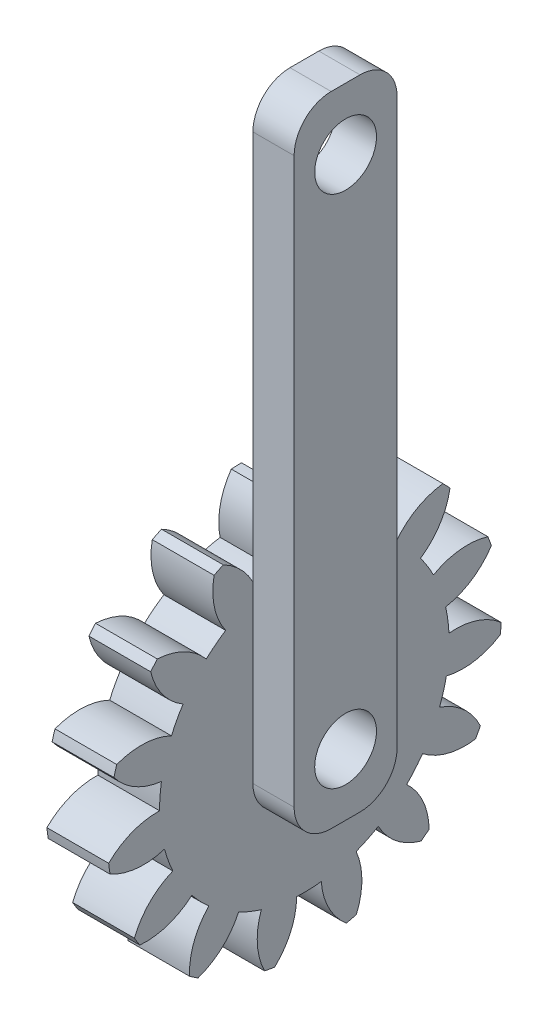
ISO-10303-21;
HEADER;
FILE_DESCRIPTION(('STEP AP214'),'2;1');
FILE_NAME('part.step','',(''),(''),'','','');
FILE_SCHEMA(('AUTOMOTIVE_DESIGN { 1 0 10303 214 1 1 1 1 }'));
ENDSEC;
DATA;
#1=APPLICATION_CONTEXT('core data for automotive mechanical design processes');
#2=APPLICATION_PROTOCOL_DEFINITION('international standard','automotive_design',2000,#1);
#3=PRODUCT_CONTEXT('',#1,'mechanical');
#4=PRODUCT('Part','Part','',(#3));
#5=PRODUCT_RELATED_PRODUCT_CATEGORY('part','',(#4));
#6=PRODUCT_DEFINITION_FORMATION('','',#4);
#7=PRODUCT_DEFINITION_CONTEXT('part definition',#1,'design');
#8=PRODUCT_DEFINITION('design','',#6,#7);
#9=PRODUCT_DEFINITION_SHAPE('','',#8);
#10=(LENGTH_UNIT() NAMED_UNIT(*) SI_UNIT(.MILLI.,.METRE.));
#11=(NAMED_UNIT(*) PLANE_ANGLE_UNIT() SI_UNIT($,.RADIAN.));
#12=(NAMED_UNIT(*) SI_UNIT($,.STERADIAN.) SOLID_ANGLE_UNIT());
#13=UNCERTAINTY_MEASURE_WITH_UNIT(LENGTH_MEASURE(1.E-05),#10,'distance_accuracy_value','');
#14=(GEOMETRIC_REPRESENTATION_CONTEXT(3) GLOBAL_UNCERTAINTY_ASSIGNED_CONTEXT((#13)) GLOBAL_UNIT_ASSIGNED_CONTEXT((#10,
#11,#12)) REPRESENTATION_CONTEXT('',''));
#15=CARTESIAN_POINT('',(0.,0.,0.));
#16=DIRECTION('',(0.,0.,1.));
#17=DIRECTION('',(1.,0.,0.));
#18=AXIS2_PLACEMENT_3D('',#15,#16,#17);
#19=CARTESIAN_POINT('',(0.,0.,0.));
#20=DIRECTION('',(1.,0.,0.));
#21=DIRECTION('',(0.,0.,-1.));
#22=AXIS2_PLACEMENT_3D('',#19,#20,#21);
#23=PLANE('',#22);
#24=CARTESIAN_POINT('',(0.,28.,0.));
#25=DIRECTION('',(1.,0.,0.));
#26=DIRECTION('',(0.,0.,-1.));
#27=AXIS2_PLACEMENT_3D('',#24,#25,#26);
#28=CIRCLE('',#27,1.5);
#29=CARTESIAN_POINT('',(0.,28.,-1.5));
#30=VERTEX_POINT('',#29);
#31=EDGE_CURVE('E508',#30,#30,#28,.T.);
#32=ORIENTED_EDGE('',*,*,#31,.T.);
#33=EDGE_LOOP('',(#32));
#34=FACE_BOUND('',#33,.T.);
#35=CARTESIAN_POINT('',(0.,8.71758485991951,5.49297889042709));
#36=DIRECTION('',(-1.,0.,0.));
#37=DIRECTION('',(0.,0.,1.));
#38=AXIS2_PLACEMENT_3D('',#35,#36,#37);
#39=CIRCLE('',#38,3.37499999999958);
#40=CARTESIAN_POINT('',(0.,10.2772971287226,2.5));
#41=VERTEX_POINT('',#40);
#42=CARTESIAN_POINT('',(0.,9.65974658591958,2.25215240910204));
#43=VERTEX_POINT('',#42);
#44=EDGE_CURVE('E1546',#41,#43,#39,.T.);
#45=ORIENTED_EDGE('',*,*,#44,.F.);
#46=DIRECTION('',(0.,-1.,0.));
#47=VECTOR('',#46,1.);
#48=CARTESIAN_POINT('',(0.,31.,2.5));
#49=LINE('',#48,#47);
#50=CARTESIAN_POINT('',(0.,29.2,2.5));
#51=VERTEX_POINT('',#50);
#52=EDGE_CURVE('E512',#51,#41,#49,.T.);
#53=ORIENTED_EDGE('',*,*,#52,.F.);
#54=CARTESIAN_POINT('',(0.,29.2,0.7));
#55=DIRECTION('',(1.,0.,0.));
#56=DIRECTION('',(0.,0.,-1.));
#57=AXIS2_PLACEMENT_3D('',#54,#55,#56);
#58=CIRCLE('',#57,1.8);
#59=CARTESIAN_POINT('',(0.,31.,0.7));
#60=VERTEX_POINT('',#59);
#61=EDGE_CURVE('E547',#51,#60,#58,.F.);
#62=ORIENTED_EDGE('',*,*,#61,.T.);
#63=DIRECTION('',(0.,0.,1.));
#64=VECTOR('',#63,1.);
#65=CARTESIAN_POINT('',(0.,31.,-2.5));
#66=LINE('',#65,#64);
#67=CARTESIAN_POINT('',(0.,31.,-0.7));
#68=VERTEX_POINT('',#67);
#69=EDGE_CURVE('E519',#68,#60,#66,.T.);
#70=ORIENTED_EDGE('',*,*,#69,.F.);
#71=CARTESIAN_POINT('',(0.,29.2,-0.7));
#72=DIRECTION('',(1.,0.,0.));
#73=DIRECTION('',(0.,0.,-1.));
#74=AXIS2_PLACEMENT_3D('',#71,#72,#73);
#75=CIRCLE('',#74,1.8);
#76=CARTESIAN_POINT('',(0.,29.2,-2.5));
#77=VERTEX_POINT('',#76);
#78=EDGE_CURVE('E544',#68,#77,#75,.F.);
#79=ORIENTED_EDGE('',*,*,#78,.T.);
#80=DIRECTION('',(0.,1.,0.));
#81=VECTOR('',#80,1.);
#82=CARTESIAN_POINT('',(0.,0.,-2.5));
#83=LINE('',#82,#81);
#84=CARTESIAN_POINT('',(0.,11.1807230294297,-2.5));
#85=VERTEX_POINT('',#84);
#86=EDGE_CURVE('E534',#85,#77,#83,.T.);
#87=ORIENTED_EDGE('',*,*,#86,.F.);
#88=CARTESIAN_POINT('',(0.,9.05360233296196,-5.12030199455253));
#89=DIRECTION('',(-1.,0.,0.));
#90=DIRECTION('',(0.,0.,1.));
#91=AXIS2_PLACEMENT_3D('',#88,#89,#90);
#92=CIRCLE('',#91,3.37499999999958);
#93=CARTESIAN_POINT('',(0.,9.78887292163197,-1.82636784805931));
#94=VERTEX_POINT('',#93);
#95=EDGE_CURVE('E1562',#94,#85,#92,.T.);
#96=ORIENTED_EDGE('',*,*,#95,.F.);
#97=CARTESIAN_POINT('',(0.,3.00000000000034,-1.12248942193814E-13));
#98=DIRECTION('',(-1.,0.,0.));
#99=DIRECTION('',(0.,0.,1.));
#100=AXIS2_PLACEMENT_3D('',#97,#98,#99);
#101=CIRCLE('',#100,7.03024999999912);
#102=CARTESIAN_POINT('',(0.,10.000014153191,-0.651319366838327));
#103=VERTEX_POINT('',#102);
#104=EDGE_CURVE('E1558',#103,#94,#101,.T.);
#105=ORIENTED_EDGE('',*,*,#104,.F.);
#106=CARTESIAN_POINT('',(0.,10.4574694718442,2.6925346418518));
#107=DIRECTION('',(-1.,0.,0.));
#108=DIRECTION('',(0.,0.,1.));
#109=AXIS2_PLACEMENT_3D('',#106,#107,#108);
#110=CIRCLE('',#109,3.37499999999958);
#111=CARTESIAN_POINT('',(0.,12.562345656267,0.0543304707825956));
#112=VERTEX_POINT('',#111);
#113=EDGE_CURVE('E1555',#112,#103,#110,.T.);
#114=ORIENTED_EDGE('',*,*,#113,.F.);
#115=CARTESIAN_POINT('',(0.,3.00000000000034,-1.12248942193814E-13));
#116=DIRECTION('',(-1.,0.,0.));
#117=DIRECTION('',(0.,0.,1.));
#118=AXIS2_PLACEMENT_3D('',#115,#116,#117);
#119=CIRCLE('',#118,9.5624999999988);
#120=CARTESIAN_POINT('',(0.,12.5466317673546,0.550661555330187));
#121=VERTEX_POINT('',#120);
#122=EDGE_CURVE('E1552',#121,#112,#119,.T.);
#123=ORIENTED_EDGE('',*,*,#122,.F.);
#124=CARTESIAN_POINT('',(0.,10.6128553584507,-2.21540673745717));
#125=DIRECTION('',(-1.,0.,0.));
#126=DIRECTION('',(0.,0.,1.));
#127=AXIS2_PLACEMENT_3D('',#124,#125,#126);
#128=CIRCLE('',#127,3.37499999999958);
#129=CARTESIAN_POINT('',(0.,9.94479474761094,1.09281333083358));
#130=VERTEX_POINT('',#129);
#131=EDGE_CURVE('E63',#130,#121,#128,.T.);
#132=ORIENTED_EDGE('',*,*,#131,.F.);
#133=CARTESIAN_POINT('',(0.,3.00000000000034,-1.12248942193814E-13));
#134=DIRECTION('',(-1.,0.,0.));
#135=DIRECTION('',(0.,0.,1.));
#136=AXIS2_PLACEMENT_3D('',#133,#134,#135);
#137=CIRCLE('',#136,7.03024999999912);
#138=EDGE_CURVE('E58',#43,#130,#137,.T.);
#139=ORIENTED_EDGE('',*,*,#138,.F.);
#140=EDGE_LOOP('',(#45,#53,#62,#70,#79,#87,#96,#105,#114,#123,#132,#139));
#141=FACE_BOUND('',#140,.T.);
#142=ADVANCED_FACE('F43',(#34,#141),#23,.F.);
#143=CARTESIAN_POINT('',(2.,0.,0.));
#144=DIRECTION('',(1.,0.,0.));
#145=DIRECTION('',(0.,0.,-1.));
#146=AXIS2_PLACEMENT_3D('',#143,#144,#145);
#147=PLANE('',#146);
#148=CARTESIAN_POINT('',(2.,28.,0.));
#149=DIRECTION('',(1.,0.,0.));
#150=DIRECTION('',(0.,0.,-1.));
#151=AXIS2_PLACEMENT_3D('',#148,#149,#150);
#152=CIRCLE('',#151,1.5);
#153=CARTESIAN_POINT('',(2.,28.,-1.5));
#154=VERTEX_POINT('',#153);
#155=EDGE_CURVE('E509',#154,#154,#152,.T.);
#156=ORIENTED_EDGE('',*,*,#155,.F.);
#157=EDGE_LOOP('',(#156));
#158=FACE_BOUND('',#157,.T.);
#159=DIRECTION('',(0.,-1.,0.));
#160=VECTOR('',#159,1.);
#161=CARTESIAN_POINT('',(2.,31.,2.5));
#162=LINE('',#161,#160);
#163=CARTESIAN_POINT('',(2.,29.2,2.5));
#164=VERTEX_POINT('',#163);
#165=CARTESIAN_POINT('',(2.,1.8,2.5));
#166=VERTEX_POINT('',#165);
#167=EDGE_CURVE('E515',#164,#166,#162,.T.);
#168=ORIENTED_EDGE('',*,*,#167,.T.);
#169=CARTESIAN_POINT('',(2.,1.8,0.699999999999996));
#170=DIRECTION('',(1.,0.,0.));
#171=DIRECTION('',(0.,0.,-1.));
#172=AXIS2_PLACEMENT_3D('',#169,#170,#171);
#173=CIRCLE('',#172,1.8);
#174=CARTESIAN_POINT('',(2.,0.,0.699999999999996));
#175=VERTEX_POINT('',#174);
#176=EDGE_CURVE('E566',#166,#175,#173,.T.);
#177=ORIENTED_EDGE('',*,*,#176,.T.);
#178=DIRECTION('',(0.,0.,-1.));
#179=VECTOR('',#178,1.);
#180=CARTESIAN_POINT('',(2.,0.,2.5));
#181=LINE('',#180,#179);
#182=CARTESIAN_POINT('',(2.,0.,-0.700000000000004));
#183=VERTEX_POINT('',#182);
#184=EDGE_CURVE('E518',#175,#183,#181,.T.);
#185=ORIENTED_EDGE('',*,*,#184,.T.);
#186=CARTESIAN_POINT('',(2.,1.8,-0.700000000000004));
#187=DIRECTION('',(1.,0.,0.));
#188=DIRECTION('',(0.,0.,-1.));
#189=AXIS2_PLACEMENT_3D('',#186,#187,#188);
#190=CIRCLE('',#189,1.8);
#191=CARTESIAN_POINT('',(2.,1.8,-2.5));
#192=VERTEX_POINT('',#191);
#193=EDGE_CURVE('E564',#183,#192,#190,.T.);
#194=ORIENTED_EDGE('',*,*,#193,.T.);
#195=DIRECTION('',(0.,1.,0.));
#196=VECTOR('',#195,1.);
#197=CARTESIAN_POINT('',(2.,0.,-2.5));
#198=LINE('',#197,#196);
#199=CARTESIAN_POINT('',(2.,29.2,-2.5));
#200=VERTEX_POINT('',#199);
#201=EDGE_CURVE('E522',#192,#200,#198,.T.);
#202=ORIENTED_EDGE('',*,*,#201,.T.);
#203=CARTESIAN_POINT('',(2.,29.2,-0.7));
#204=DIRECTION('',(1.,0.,0.));
#205=DIRECTION('',(0.,0.,-1.));
#206=AXIS2_PLACEMENT_3D('',#203,#204,#205);
#207=CIRCLE('',#206,1.8);
#208=CARTESIAN_POINT('',(2.,31.,-0.7));
#209=VERTEX_POINT('',#208);
#210=EDGE_CURVE('E560',#200,#209,#207,.T.);
#211=ORIENTED_EDGE('',*,*,#210,.T.);
#212=DIRECTION('',(0.,0.,1.));
#213=VECTOR('',#212,1.);
#214=CARTESIAN_POINT('',(2.,31.,-2.5));
#215=LINE('',#214,#213);
#216=CARTESIAN_POINT('',(2.,31.,0.7));
#217=VERTEX_POINT('',#216);
#218=EDGE_CURVE('E525',#209,#217,#215,.T.);
#219=ORIENTED_EDGE('',*,*,#218,.T.);
#220=CARTESIAN_POINT('',(2.,29.2,0.7));
#221=DIRECTION('',(1.,0.,0.));
#222=DIRECTION('',(0.,0.,-1.));
#223=AXIS2_PLACEMENT_3D('',#220,#221,#222);
#224=CIRCLE('',#223,1.8);
#225=EDGE_CURVE('E562',#217,#164,#224,.T.);
#226=ORIENTED_EDGE('',*,*,#225,.T.);
#227=EDGE_LOOP('',(#168,#177,#185,#194,#202,#211,#219,#226));
#228=FACE_BOUND('',#227,.T.);
#229=CARTESIAN_POINT('',(2.,3.,0.));
#230=DIRECTION('',(1.,0.,0.));
#231=DIRECTION('',(0.,0.,-1.));
#232=AXIS2_PLACEMENT_3D('',#229,#230,#231);
#233=CIRCLE('',#232,1.5);
#234=CARTESIAN_POINT('',(2.,3.,-1.5));
#235=VERTEX_POINT('',#234);
#236=EDGE_CURVE('E500',#235,#235,#233,.T.);
#237=ORIENTED_EDGE('',*,*,#236,.F.);
#238=EDGE_LOOP('',(#237));
#239=FACE_BOUND('',#238,.T.);
#240=ADVANCED_FACE('F593',(#158,#228,#239),#147,.T.);
#241=CARTESIAN_POINT('',(2.,31.,2.5));
#242=DIRECTION('',(0.,0.,-1.));
#243=DIRECTION('',(0.,1.,0.));
#244=AXIS2_PLACEMENT_3D('',#241,#242,#243);
#245=PLANE('',#244);
#246=ORIENTED_EDGE('',*,*,#52,.T.);
#247=DIRECTION('',(0.,1.,0.));
#248=VECTOR('',#247,1.);
#249=CARTESIAN_POINT('',(0.,31.,2.5));
#250=LINE('',#249,#248);
#251=CARTESIAN_POINT('',(0.,1.8,2.5));
#252=VERTEX_POINT('',#251);
#253=EDGE_CURVE('E497',#252,#41,#250,.T.);
#254=ORIENTED_EDGE('',*,*,#253,.F.);
#255=DIRECTION('',(-1.,0.,0.));
#256=VECTOR('',#255,1.);
#257=CARTESIAN_POINT('',(2.,1.8,2.5));
#258=LINE('',#257,#256);
#259=EDGE_CURVE('E558',#252,#166,#258,.F.);
#260=ORIENTED_EDGE('',*,*,#259,.T.);
#261=ORIENTED_EDGE('',*,*,#167,.F.);
#262=DIRECTION('',(-1.,0.,0.));
#263=VECTOR('',#262,1.);
#264=CARTESIAN_POINT('',(2.,29.2,2.5));
#265=LINE('',#264,#263);
#266=EDGE_CURVE('E555',#164,#51,#265,.T.);
#267=ORIENTED_EDGE('',*,*,#266,.T.);
#268=EDGE_LOOP('',(#246,#254,#260,#261,#267));
#269=FACE_BOUND('',#268,.T.);
#270=ADVANCED_FACE('F589',(#269),#245,.F.);
#271=CARTESIAN_POINT('',(2.,0.,2.5));
#272=DIRECTION('',(0.,1.,0.));
#273=DIRECTION('',(0.,0.,1.));
#274=AXIS2_PLACEMENT_3D('',#271,#272,#273);
#275=PLANE('',#274);
#276=ORIENTED_EDGE('',*,*,#184,.F.);
#277=DIRECTION('',(-1.,0.,0.));
#278=VECTOR('',#277,1.);
#279=CARTESIAN_POINT('',(2.,0.,0.699999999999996));
#280=LINE('',#279,#278);
#281=CARTESIAN_POINT('',(0.,0.,0.699999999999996));
#282=VERTEX_POINT('',#281);
#283=EDGE_CURVE('E541',#175,#282,#280,.T.);
#284=ORIENTED_EDGE('',*,*,#283,.T.);
#285=DIRECTION('',(0.,0.,-1.));
#286=VECTOR('',#285,1.);
#287=CARTESIAN_POINT('',(0.,0.,2.5));
#288=LINE('',#287,#286);
#289=CARTESIAN_POINT('',(0.,0.,-0.700000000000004));
#290=VERTEX_POINT('',#289);
#291=EDGE_CURVE('E531',#282,#290,#288,.T.);
#292=ORIENTED_EDGE('',*,*,#291,.T.);
#293=DIRECTION('',(-1.,0.,0.));
#294=VECTOR('',#293,1.);
#295=CARTESIAN_POINT('',(2.,0.,-0.700000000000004));
#296=LINE('',#295,#294);
#297=EDGE_CURVE('E528',#290,#183,#296,.F.);
#298=ORIENTED_EDGE('',*,*,#297,.T.);
#299=EDGE_LOOP('',(#276,#284,#292,#298));
#300=FACE_BOUND('',#299,.T.);
#301=ADVANCED_FACE('F601',(#300),#275,.F.);
#302=CARTESIAN_POINT('',(2.,0.,-2.5));
#303=DIRECTION('',(0.,0.,1.));
#304=DIRECTION('',(0.,-1.,0.));
#305=AXIS2_PLACEMENT_3D('',#302,#303,#304);
#306=PLANE('',#305);
#307=ORIENTED_EDGE('',*,*,#201,.F.);
#308=DIRECTION('',(-1.,0.,0.));
#309=VECTOR('',#308,1.);
#310=CARTESIAN_POINT('',(2.,1.8,-2.5));
#311=LINE('',#310,#309);
#312=CARTESIAN_POINT('',(0.,1.8,-2.5));
#313=VERTEX_POINT('',#312);
#314=EDGE_CURVE('E570',#192,#313,#311,.T.);
#315=ORIENTED_EDGE('',*,*,#314,.T.);
#316=EDGE_CURVE('E535',#313,#85,#83,.T.);
#317=ORIENTED_EDGE('',*,*,#316,.T.);
#318=ORIENTED_EDGE('',*,*,#86,.T.);
#319=DIRECTION('',(-1.,0.,0.));
#320=VECTOR('',#319,1.);
#321=CARTESIAN_POINT('',(2.,29.2,-2.5));
#322=LINE('',#321,#320);
#323=EDGE_CURVE('E568',#77,#200,#322,.F.);
#324=ORIENTED_EDGE('',*,*,#323,.T.);
#325=EDGE_LOOP('',(#307,#315,#317,#318,#324));
#326=FACE_BOUND('',#325,.T.);
#327=ADVANCED_FACE('F612',(#326),#306,.F.);
#328=CARTESIAN_POINT('',(2.,31.,-2.5));
#329=DIRECTION('',(0.,-1.,0.));
#330=DIRECTION('',(0.,0.,-1.));
#331=AXIS2_PLACEMENT_3D('',#328,#329,#330);
#332=PLANE('',#331);
#333=ORIENTED_EDGE('',*,*,#69,.T.);
#334=DIRECTION('',(-1.,0.,0.));
#335=VECTOR('',#334,1.);
#336=CARTESIAN_POINT('',(2.,31.,0.7));
#337=LINE('',#336,#335);
#338=EDGE_CURVE('E11',#60,#217,#337,.F.);
#339=ORIENTED_EDGE('',*,*,#338,.T.);
#340=ORIENTED_EDGE('',*,*,#218,.F.);
#341=DIRECTION('',(-1.,0.,0.));
#342=VECTOR('',#341,1.);
#343=CARTESIAN_POINT('',(2.,31.,-0.7));
#344=LINE('',#343,#342);
#345=EDGE_CURVE('E51',#209,#68,#344,.T.);
#346=ORIENTED_EDGE('',*,*,#345,.T.);
#347=EDGE_LOOP('',(#333,#339,#340,#346));
#348=FACE_BOUND('',#347,.T.);
#349=ADVANCED_FACE('F577',(#348),#332,.F.);
#350=CARTESIAN_POINT('',(2.,28.,0.));
#351=DIRECTION('',(-1.,0.,0.));
#352=DIRECTION('',(0.,0.,1.));
#353=AXIS2_PLACEMENT_3D('',#350,#351,#352);
#354=CYLINDRICAL_SURFACE('',#353,1.5);
#355=ORIENTED_EDGE('',*,*,#155,.T.);
#356=EDGE_LOOP('',(#355));
#357=FACE_BOUND('',#356,.T.);
#358=ORIENTED_EDGE('',*,*,#31,.F.);
#359=EDGE_LOOP('',(#358));
#360=FACE_BOUND('',#359,.T.);
#361=ADVANCED_FACE('F632',(#357,#360),#354,.F.);
#362=CARTESIAN_POINT('',(2.,3.,0.));
#363=DIRECTION('',(-1.,0.,0.));
#364=DIRECTION('',(0.,0.,1.));
#365=AXIS2_PLACEMENT_3D('',#362,#363,#364);
#366=CYLINDRICAL_SURFACE('',#365,1.5);
#367=ORIENTED_EDGE('',*,*,#236,.T.);
#368=EDGE_LOOP('',(#367));
#369=FACE_BOUND('',#368,.T.);
#370=CARTESIAN_POINT('',(-3.,3.00000000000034,-1.11022302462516E-13));
#371=DIRECTION('',(-1.,0.,0.));
#372=DIRECTION('',(0.,0.,1.));
#373=AXIS2_PLACEMENT_3D('',#370,#371,#372);
#374=CIRCLE('',#373,1.5);
#375=CARTESIAN_POINT('',(-3.,3.00000000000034,1.49999999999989));
#376=VERTEX_POINT('',#375);
#377=EDGE_CURVE('E1335',#376,#376,#374,.T.);
#378=ORIENTED_EDGE('',*,*,#377,.T.);
#379=EDGE_LOOP('',(#378));
#380=FACE_BOUND('',#379,.T.);
#381=ADVANCED_FACE('F640',(#369,#380),#366,.F.);
#382=CARTESIAN_POINT('',(2.,1.8,0.699999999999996));
#383=DIRECTION('',(-1.,0.,0.));
#384=DIRECTION('',(0.,0.,1.));
#385=AXIS2_PLACEMENT_3D('',#382,#383,#384);
#386=CYLINDRICAL_SURFACE('',#385,1.8);
#387=ORIENTED_EDGE('',*,*,#176,.F.);
#388=ORIENTED_EDGE('',*,*,#259,.F.);
#389=CARTESIAN_POINT('',(0.,1.8,0.699999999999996));
#390=DIRECTION('',(1.,0.,0.));
#391=DIRECTION('',(0.,0.,-1.));
#392=AXIS2_PLACEMENT_3D('',#389,#390,#391);
#393=CIRCLE('',#392,1.8);
#394=EDGE_CURVE('E552',#282,#252,#393,.F.);
#395=ORIENTED_EDGE('',*,*,#394,.F.);
#396=ORIENTED_EDGE('',*,*,#283,.F.);
#397=EDGE_LOOP('',(#387,#388,#395,#396));
#398=FACE_BOUND('',#397,.T.);
#399=ADVANCED_FACE('F598',(#398),#386,.T.);
#400=CARTESIAN_POINT('',(2.,1.8,-0.700000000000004));
#401=DIRECTION('',(-1.,0.,0.));
#402=DIRECTION('',(0.,0.,1.));
#403=AXIS2_PLACEMENT_3D('',#400,#401,#402);
#404=CYLINDRICAL_SURFACE('',#403,1.8);
#405=ORIENTED_EDGE('',*,*,#193,.F.);
#406=ORIENTED_EDGE('',*,*,#297,.F.);
#407=CARTESIAN_POINT('',(0.,1.8,-0.700000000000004));
#408=DIRECTION('',(1.,0.,0.));
#409=DIRECTION('',(0.,0.,-1.));
#410=AXIS2_PLACEMENT_3D('',#407,#408,#409);
#411=CIRCLE('',#410,1.8);
#412=EDGE_CURVE('E549',#313,#290,#411,.F.);
#413=ORIENTED_EDGE('',*,*,#412,.F.);
#414=ORIENTED_EDGE('',*,*,#314,.F.);
#415=EDGE_LOOP('',(#405,#406,#413,#414));
#416=FACE_BOUND('',#415,.T.);
#417=ADVANCED_FACE('F609',(#416),#404,.T.);
#418=CARTESIAN_POINT('',(2.,29.2,0.7));
#419=DIRECTION('',(-1.,0.,0.));
#420=DIRECTION('',(0.,0.,1.));
#421=AXIS2_PLACEMENT_3D('',#418,#419,#420);
#422=CYLINDRICAL_SURFACE('',#421,1.8);
#423=ORIENTED_EDGE('',*,*,#225,.F.);
#424=ORIENTED_EDGE('',*,*,#338,.F.);
#425=ORIENTED_EDGE('',*,*,#61,.F.);
#426=ORIENTED_EDGE('',*,*,#266,.F.);
#427=EDGE_LOOP('',(#423,#424,#425,#426));
#428=FACE_BOUND('',#427,.T.);
#429=ADVANCED_FACE('F586',(#428),#422,.T.);
#430=CARTESIAN_POINT('',(2.,29.2,-0.7));
#431=DIRECTION('',(-1.,0.,0.));
#432=DIRECTION('',(0.,0.,1.));
#433=AXIS2_PLACEMENT_3D('',#430,#431,#432);
#434=CYLINDRICAL_SURFACE('',#433,1.8);
#435=ORIENTED_EDGE('',*,*,#210,.F.);
#436=ORIENTED_EDGE('',*,*,#323,.F.);
#437=ORIENTED_EDGE('',*,*,#78,.F.);
#438=ORIENTED_EDGE('',*,*,#345,.F.);
#439=EDGE_LOOP('',(#435,#436,#437,#438));
#440=FACE_BOUND('',#439,.T.);
#441=ADVANCED_FACE('F45',(#440),#434,.T.);
#442=CARTESIAN_POINT('',(0.,3.12276233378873,-3.96242701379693));
#443=DIRECTION('',(-1.,0.,0.));
#444=DIRECTION('',(0.,0.,1.));
#445=AXIS2_PLACEMENT_3D('',#442,#443,#444);
#446=PLANE('',#445);
#447=ORIENTED_EDGE('',*,*,#394,.T.);
#448=ORIENTED_EDGE('',*,*,#253,.T.);
#449=CARTESIAN_POINT('',(0.,11.7135392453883,3.93898972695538));
#450=VERTEX_POINT('',#449);
#451=EDGE_CURVE('E1547',#450,#41,#39,.T.);
#452=ORIENTED_EDGE('',*,*,#451,.F.);
#453=CARTESIAN_POINT('',(0.,3.00000000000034,-1.12248942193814E-13));
#454=DIRECTION('',(-1.,0.,0.));
#455=DIRECTION('',(0.,0.,1.));
#456=AXIS2_PLACEMENT_3D('',#453,#454,#455);
#457=CIRCLE('',#456,9.5624999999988);
#458=CARTESIAN_POINT('',(0.,11.4973078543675,4.38601932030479));
#459=VERTEX_POINT('',#458);
#460=EDGE_CURVE('E1544',#459,#450,#457,.T.);
#461=ORIENTED_EDGE('',*,*,#460,.F.);
#462=CARTESIAN_POINT('',(0.,10.8557765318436,1.07255247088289));
#463=DIRECTION('',(-1.,0.,0.));
#464=DIRECTION('',(0.,0.,1.));
#465=AXIS2_PLACEMENT_3D('',#462,#463,#464);
#466=CIRCLE('',#465,3.37499999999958);
#467=CARTESIAN_POINT('',(0.,8.89989847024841,3.82303715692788));
#468=VERTEX_POINT('',#467);
#469=EDGE_CURVE('E1542',#468,#459,#466,.T.);
#470=ORIENTED_EDGE('',*,*,#469,.F.);
#471=CARTESIAN_POINT('',(0.,3.00000000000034,-1.12248942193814E-13));
#472=DIRECTION('',(-1.,0.,0.));
#473=DIRECTION('',(0.,0.,1.));
#474=AXIS2_PLACEMENT_3D('',#471,#472,#473);
#475=CIRCLE('',#474,7.03024999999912);
#476=CARTESIAN_POINT('',(0.,8.16794833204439,4.76620657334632));
#477=VERTEX_POINT('',#476);
#478=EDGE_CURVE('E1540',#477,#468,#475,.T.);
#479=ORIENTED_EDGE('',*,*,#478,.F.);
#480=CARTESIAN_POINT('',(0.,5.989077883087,7.3436371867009));
#481=DIRECTION('',(-1.,0.,0.));
#482=DIRECTION('',(0.,0.,1.));
#483=AXIS2_PLACEMENT_3D('',#480,#481,#482);
#484=CIRCLE('',#483,3.37499999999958);
#485=CARTESIAN_POINT('',(0.,9.3580827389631,7.1425618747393));
#486=VERTEX_POINT('',#485);
#487=EDGE_CURVE('E1538',#486,#477,#484,.T.);
#488=ORIENTED_EDGE('',*,*,#487,.F.);
#489=CARTESIAN_POINT('',(0.,3.00000000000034,-1.12248942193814E-13));
#490=DIRECTION('',(-1.,0.,0.));
#491=DIRECTION('',(0.,0.,1.));
#492=AXIS2_PLACEMENT_3D('',#489,#490,#491);
#493=CIRCLE('',#492,9.5624999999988);
#494=CARTESIAN_POINT('',(0.,8.9787222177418,7.46299449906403));
#495=VERTEX_POINT('',#494);
#496=EDGE_CURVE('E1536',#495,#486,#493,.T.);
#497=ORIENTED_EDGE('',*,*,#496,.F.);
#498=CARTESIAN_POINT('',(0.,9.74036257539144,4.17505761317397));
#499=DIRECTION('',(-1.,0.,0.));
#500=DIRECTION('',(0.,0.,1.));
#501=AXIS2_PLACEMENT_3D('',#498,#499,#500);
#502=CIRCLE('',#501,3.37499999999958);
#503=CARTESIAN_POINT('',(0.,6.83485614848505,5.89222312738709));
#504=VERTEX_POINT('',#503);
#505=EDGE_CURVE('E1534',#504,#495,#502,.T.);
#506=ORIENTED_EDGE('',*,*,#505,.F.);
#507=CARTESIAN_POINT('',(0.,3.00000000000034,-1.12248942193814E-13));
#508=DIRECTION('',(-1.,0.,0.));
#509=DIRECTION('',(0.,0.,1.));
#510=AXIS2_PLACEMENT_3D('',#507,#508,#509);
#511=CIRCLE('',#510,7.03024999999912);
#512=CARTESIAN_POINT('',(0.,5.78256486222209,6.45614032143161));
#513=VERTEX_POINT('',#512);
#514=EDGE_CURVE('E1532',#513,#504,#511,.T.);
#515=ORIENTED_EDGE('',*,*,#514,.F.);
#516=CARTESIAN_POINT('',(0.,2.74373218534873,7.92451389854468));
#517=DIRECTION('',(-1.,0.,0.));
#518=DIRECTION('',(0.,0.,1.));
#519=AXIS2_PLACEMENT_3D('',#516,#517,#518);
#520=CIRCLE('',#519,3.37499999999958);
#521=CARTESIAN_POINT('',(0.,5.90325596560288,9.1111201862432));
#522=VERTEX_POINT('',#521);
#523=EDGE_CURVE('E1530',#522,#513,#520,.T.);
#524=ORIENTED_EDGE('',*,*,#523,.F.);
#525=CARTESIAN_POINT('',(0.,3.00000000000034,-1.12248942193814E-13));
#526=DIRECTION('',(-1.,0.,0.));
#527=DIRECTION('',(0.,0.,1.));
#528=AXIS2_PLACEMENT_3D('',#525,#526,#527);
#529=CIRCLE('',#528,9.5624999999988);
#530=CARTESIAN_POINT('',(0.,5.42636119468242,9.24955012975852));
#531=VERTEX_POINT('',#530);
#532=EDGE_CURVE('E1528',#531,#522,#529,.T.);
#533=ORIENTED_EDGE('',*,*,#532,.F.);
#534=CARTESIAN_POINT('',(0.,7.45947869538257,6.55565736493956));
#535=DIRECTION('',(-1.,0.,0.));
#536=DIRECTION('',(0.,0.,1.));
#537=AXIS2_PLACEMENT_3D('',#534,#535,#536);
#538=CIRCLE('',#537,3.37499999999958);
#539=CARTESIAN_POINT('',(0.,4.10673236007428,6.94259018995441));
#540=VERTEX_POINT('',#539);
#541=EDGE_CURVE('E1526',#540,#531,#538,.T.);
#542=ORIENTED_EDGE('',*,*,#541,.F.);
#543=CARTESIAN_POINT('',(0.,3.00000000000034,-1.12248942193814E-13));
#544=DIRECTION('',(-1.,0.,0.));
#545=DIRECTION('',(0.,0.,1.));
#546=AXIS2_PLACEMENT_3D('',#543,#544,#545);
#547=CIRCLE('',#546,7.03024999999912);
#548=CARTESIAN_POINT('',(0.,2.91605064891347,7.02974875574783));
#549=VERTEX_POINT('',#548);
#550=EDGE_CURVE('E1524',#549,#540,#547,.T.);
#551=ORIENTED_EDGE('',*,*,#550,.F.);
#552=CARTESIAN_POINT('',(0.,-0.457302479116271,7.13517016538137));
#553=DIRECTION('',(-1.,0.,0.));
#554=DIRECTION('',(0.,0.,1.));
#555=AXIS2_PLACEMENT_3D('',#552,#553,#554);
#556=CIRCLE('',#555,3.37499999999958);
#557=CARTESIAN_POINT('',(0.,1.94642986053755,9.50428304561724));
#558=VERTEX_POINT('',#557);
#559=EDGE_CURVE('E1522',#558,#549,#556,.T.);
#560=ORIENTED_EDGE('',*,*,#559,.F.);
#561=CARTESIAN_POINT('',(0.,3.00000000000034,-1.12248942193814E-13));
#562=DIRECTION('',(-1.,0.,0.));
#563=DIRECTION('',(0.,0.,1.));
#564=AXIS2_PLACEMENT_3D('',#561,#562,#563);
#565=CIRCLE('',#564,9.5624999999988);
#566=CARTESIAN_POINT('',(0.,1.45446027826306,9.4367745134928));
#567=VERTEX_POINT('',#566);
#568=EDGE_CURVE('E1520',#567,#558,#565,.T.);
#569=ORIENTED_EDGE('',*,*,#568,.F.);
#570=CARTESIAN_POINT('',(0.,4.40751043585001,7.80272440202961));
#571=DIRECTION('',(-1.,0.,0.));
#572=DIRECTION('',(0.,0.,1.));
#573=AXIS2_PLACEMENT_3D('',#570,#571,#572);
#574=CIRCLE('',#573,3.37499999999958);
#575=CARTESIAN_POINT('',(0.,1.18724449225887,6.79252033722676));
#576=VERTEX_POINT('',#575);
#577=EDGE_CURVE('E1518',#576,#567,#574,.T.);
#578=ORIENTED_EDGE('',*,*,#577,.F.);
#579=CARTESIAN_POINT('',(0.,3.00000000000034,-1.12248942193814E-13));
#580=DIRECTION('',(-1.,0.,0.));
#581=DIRECTION('',(0.,0.,1.));
#582=AXIS2_PLACEMENT_3D('',#579,#580,#581);
#583=CIRCLE('',#582,7.03024999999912);
#584=CARTESIAN_POINT('',(0.,0.0640520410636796,6.38784976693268));
#585=VERTEX_POINT('',#584);
#586=EDGE_CURVE('E1516',#585,#576,#583,.T.);
#587=ORIENTED_EDGE('',*,*,#586,.F.);
#588=CARTESIAN_POINT('',(0.,-3.06053813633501,5.11209068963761));
#589=DIRECTION('',(-1.,0.,0.));
#590=DIRECTION('',(0.,0.,1.));
#591=AXIS2_PLACEMENT_3D('',#588,#589,#590);
#592=CIRCLE('',#591,3.37499999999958);
#593=CARTESIAN_POINT('',(0.,-1.82822439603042,8.25406902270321));
#594=VERTEX_POINT('',#593);
#595=EDGE_CURVE('E1514',#594,#585,#592,.T.);
#596=ORIENTED_EDGE('',*,*,#595,.F.);
#597=CARTESIAN_POINT('',(0.,3.00000000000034,-1.12248942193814E-13));
#598=DIRECTION('',(-1.,0.,0.));
#599=DIRECTION('',(0.,0.,1.));
#600=AXIS2_PLACEMENT_3D('',#597,#598,#599);
#601=CIRCLE('',#600,9.56249999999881);
#602=CARTESIAN_POINT('',(0.,-2.25020277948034,7.99229485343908));
#603=VERTEX_POINT('',#602);
#604=EDGE_CURVE('E1512',#603,#594,#601,.T.);
#605=ORIENTED_EDGE('',*,*,#604,.F.);
#606=CARTESIAN_POINT('',(0.,1.11217083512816,7.70062950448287));
#607=DIRECTION('',(-1.,0.,0.));
#608=DIRECTION('',(0.,0.,1.));
#609=AXIS2_PLACEMENT_3D('',#606,#607,#608);
#610=CIRCLE('',#609,3.37499999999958);
#611=CARTESIAN_POINT('',(0.,-1.41880147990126,5.46796201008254));
#612=VERTEX_POINT('',#611);
#613=EDGE_CURVE('E1510',#612,#603,#610,.T.);
#614=ORIENTED_EDGE('',*,*,#613,.F.);
#615=CARTESIAN_POINT('',(0.,3.00000000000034,-1.12248942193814E-13));
#616=DIRECTION('',(-1.,0.,0.));
#617=DIRECTION('',(0.,0.,1.));
#618=AXIS2_PLACEMENT_3D('',#615,#616,#617);
#619=CIRCLE('',#618,7.03024999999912);
#620=CARTESIAN_POINT('',(0.,-2.28029449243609,4.64143352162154));
#621=VERTEX_POINT('',#620);
#622=EDGE_CURVE('E1508',#621,#612,#619,.T.);
#623=ORIENTED_EDGE('',*,*,#622,.F.);
#624=CARTESIAN_POINT('',(0.,-4.61585169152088,2.20508429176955));
#625=DIRECTION('',(-1.,0.,0.));
#626=DIRECTION('',(0.,0.,1.));
#627=AXIS2_PLACEMENT_3D('',#624,#625,#626);
#628=CIRCLE('',#627,3.37499999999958);
#629=CARTESIAN_POINT('',(0.,-4.76803479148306,5.57665147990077));
#630=VERTEX_POINT('',#629);
#631=EDGE_CURVE('E1506',#630,#621,#628,.T.);
#632=ORIENTED_EDGE('',*,*,#631,.F.);
#633=CARTESIAN_POINT('',(0.,3.00000000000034,-1.12248942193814E-13));
#634=DIRECTION('',(-1.,0.,0.));
#635=DIRECTION('',(0.,0.,1.));
#636=AXIS2_PLACEMENT_3D('',#633,#634,#635);
#637=CIRCLE('',#636,9.5624999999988);
#638=CARTESIAN_POINT('',(0.,-5.04705808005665,5.16587480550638));
#639=VERTEX_POINT('',#638);
#640=EDGE_CURVE('E1504',#639,#630,#637,.T.);
#641=ORIENTED_EDGE('',*,*,#640,.F.);
#642=CARTESIAN_POINT('',(0.,-1.85674595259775,6.2670258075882));
#643=DIRECTION('',(-1.,0.,0.));
#644=DIRECTION('',(0.,0.,1.));
#645=AXIS2_PLACEMENT_3D('',#642,#643,#644);
#646=CIRCLE('',#645,3.37499999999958);
#647=CARTESIAN_POINT('',(0.,-3.26079653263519,3.19794337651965));
#648=VERTEX_POINT('',#647);
#649=EDGE_CURVE('E1502',#648,#639,#646,.T.);
#650=ORIENTED_EDGE('',*,*,#649,.F.);
#651=CARTESIAN_POINT('',(0.,3.00000000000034,-1.12248942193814E-13));
#652=DIRECTION('',(-1.,0.,0.));
#653=DIRECTION('',(0.,0.,1.));
#654=AXIS2_PLACEMENT_3D('',#651,#652,#653);
#655=CIRCLE('',#654,7.03024999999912);
#656=CARTESIAN_POINT('',(0.,-3.71163013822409,2.09247125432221));
#657=VERTEX_POINT('',#656);
#658=EDGE_CURVE('E1500',#657,#648,#655,.T.);
#659=ORIENTED_EDGE('',*,*,#658,.F.);
#660=CARTESIAN_POINT('',(0.,-4.85431530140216,-1.08320121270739));
#661=DIRECTION('',(-1.,0.,0.));
#662=DIRECTION('',(0.,0.,1.));
#663=AXIS2_PLACEMENT_3D('',#660,#661,#662);
#664=CIRCLE('',#663,3.37499999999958);
#665=CARTESIAN_POINT('',(0.,-6.36468140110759,1.93498023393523));
#666=VERTEX_POINT('',#665);
#667=EDGE_CURVE('E1498',#666,#657,#664,.T.);
#668=ORIENTED_EDGE('',*,*,#667,.F.);
#669=CARTESIAN_POINT('',(0.,3.00000000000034,-1.12248942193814E-13));
#670=DIRECTION('',(-1.,0.,0.));
#671=DIRECTION('',(0.,0.,1.));
#672=AXIS2_PLACEMENT_3D('',#669,#670,#671);
#673=CIRCLE('',#672,9.5624999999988);
#674=CARTESIAN_POINT('',(0.,-6.45250393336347,1.44622807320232));
#675=VERTEX_POINT('',#674);
#676=EDGE_CURVE('E1496',#675,#666,#673,.T.);
#677=ORIENTED_EDGE('',*,*,#676,.F.);
#678=CARTESIAN_POINT('',(0.,-3.98588724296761,3.74979641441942));
#679=DIRECTION('',(-1.,0.,0.));
#680=DIRECTION('',(0.,0.,1.));
#681=AXIS2_PLACEMENT_3D('',#678,#679,#680);
#682=CIRCLE('',#681,3.37499999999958);
#683=CARTESIAN_POINT('',(0.,-4.02024298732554,0.374971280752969));
#684=VERTEX_POINT('',#683);
#685=EDGE_CURVE('E1494',#684,#675,#682,.T.);
#686=ORIENTED_EDGE('',*,*,#685,.F.);
#687=CARTESIAN_POINT('',(0.,3.00000000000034,-1.12248942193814E-13));
#688=DIRECTION('',(-1.,0.,0.));
#689=DIRECTION('',(0.,0.,1.));
#690=AXIS2_PLACEMENT_3D('',#687,#688,#689);
#691=CIRCLE('',#690,7.03024999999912);
#692=CARTESIAN_POINT('',(0.,-3.98246395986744,-0.818298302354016));
#693=VERTEX_POINT('',#692);
#694=EDGE_CURVE('E1492',#693,#684,#691,.T.);
#695=ORIENTED_EDGE('',*,*,#694,.F.);
#696=CARTESIAN_POINT('',(0.,-3.73469644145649,-4.18419138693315));
#697=DIRECTION('',(-1.,0.,0.));
#698=DIRECTION('',(0.,0.,1.));
#699=AXIS2_PLACEMENT_3D('',#696,#697,#698);
#700=CIRCLE('',#699,3.37499999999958);
#701=CARTESIAN_POINT('',(0.,-6.34208952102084,-2.04126667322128));
#702=VERTEX_POINT('',#701);
#703=EDGE_CURVE('E1490',#702,#693,#700,.T.);
#704=ORIENTED_EDGE('',*,*,#703,.F.);
#705=CARTESIAN_POINT('',(0.,3.00000000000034,-1.12248942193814E-13));
#706=DIRECTION('',(-1.,0.,0.));
#707=DIRECTION('',(0.,0.,1.));
#708=AXIS2_PLACEMENT_3D('',#705,#706,#707);
#709=CIRCLE('',#708,9.5624999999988);
#710=CARTESIAN_POINT('',(0.,-6.22352598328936,-2.5234846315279));
#711=VERTEX_POINT('',#710);
#712=EDGE_CURVE('E1488',#711,#702,#709,.T.);
#713=ORIENTED_EDGE('',*,*,#712,.F.);
#714=CARTESIAN_POINT('',(0.,-4.90710516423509,0.584193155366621));
#715=DIRECTION('',(-1.,0.,0.));
#716=DIRECTION('',(0.,0.,1.));
#717=AXIS2_PLACEMENT_3D('',#714,#715,#716);
#718=CIRCLE('',#717,3.37499999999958);
#719=CARTESIAN_POINT('',(0.,-3.56582565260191,-2.51283675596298));
#720=VERTEX_POINT('',#719);
#721=EDGE_CURVE('E1486',#720,#711,#718,.T.);
#722=ORIENTED_EDGE('',*,*,#721,.F.);
#723=CARTESIAN_POINT('',(0.,3.00000000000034,-1.12248942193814E-13));
#724=DIRECTION('',(-1.,0.,0.));
#725=DIRECTION('',(0.,0.,1.));
#726=AXIS2_PLACEMENT_3D('',#723,#724,#725);
#727=CIRCLE('',#726,7.03024999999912);
#728=CARTESIAN_POINT('',(0.,-3.04596632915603,-3.58757664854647));
#729=VERTEX_POINT('',#728);
#730=EDGE_CURVE('E1484',#729,#720,#727,.T.);
#731=ORIENTED_EDGE('',*,*,#730,.F.);
#732=CARTESIAN_POINT('',(0.,-1.4505873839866,-6.56169685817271));
#733=DIRECTION('',(-1.,0.,0.));
#734=DIRECTION('',(0.,0.,1.));
#735=AXIS2_PLACEMENT_3D('',#732,#733,#734);
#736=CIRCLE('',#735,3.37499999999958);
#737=CARTESIAN_POINT('',(0.,-4.70416549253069,-5.6645600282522));
#738=VERTEX_POINT('',#737);
#739=EDGE_CURVE('E1482',#738,#729,#736,.T.);
#740=ORIENTED_EDGE('',*,*,#739,.F.);
#741=CARTESIAN_POINT('',(0.,3.00000000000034,-1.12248942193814E-13));
#742=DIRECTION('',(-1.,0.,0.));
#743=DIRECTION('',(0.,0.,1.));
#744=AXIS2_PLACEMENT_3D('',#741,#742,#743);
#745=CIRCLE('',#744,9.5624999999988);
#746=CARTESIAN_POINT('',(0.,-4.39971659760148,-6.05686391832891));
#747=VERTEX_POINT('',#746);
#748=EDGE_CURVE('E1480',#747,#738,#745,.T.);
#749=ORIENTED_EDGE('',*,*,#748,.F.);
#750=CARTESIAN_POINT('',(0.,-4.46111276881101,-2.68242240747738));
#751=DIRECTION('',(-1.,0.,0.));
#752=DIRECTION('',(0.,0.,1.));
#753=AXIS2_PLACEMENT_3D('',#750,#751,#752);
#754=CIRCLE('',#753,3.37499999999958);
#755=CARTESIAN_POINT('',(0.,-1.97611741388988,-4.96615248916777));
#756=VERTEX_POINT('',#755);
#757=EDGE_CURVE('E1478',#756,#747,#754,.T.);
#758=ORIENTED_EDGE('',*,*,#757,.F.);
#759=CARTESIAN_POINT('',(0.,3.00000000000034,-1.12248942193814E-13));
#760=DIRECTION('',(-1.,0.,0.));
#761=DIRECTION('',(0.,0.,1.));
#762=AXIS2_PLACEMENT_3D('',#759,#760,#761);
#763=CIRCLE('',#762,7.03024999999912);
#764=CARTESIAN_POINT('',(0.,-1.06406619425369,-5.73653040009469));
#765=VERTEX_POINT('',#764);
#766=EDGE_CURVE('E1476',#765,#756,#763,.T.);
#767=ORIENTED_EDGE('',*,*,#766,.F.);
#768=CARTESIAN_POINT('',(0.,1.60306866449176,-7.80462533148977));
#769=DIRECTION('',(-1.,0.,0.));
#770=DIRECTION('',(0.,0.,1.));
#771=AXIS2_PLACEMENT_3D('',#768,#769,#770);
#772=CIRCLE('',#771,3.37499999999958);
#773=CARTESIAN_POINT('',(0.,-1.73412126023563,-8.30839949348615));
#774=VERTEX_POINT('',#773);
#775=EDGE_CURVE('E1474',#774,#765,#772,.T.);
#776=ORIENTED_EDGE('',*,*,#775,.F.);
#777=CARTESIAN_POINT('',(0.,3.00000000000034,-1.12248942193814E-13));
#778=DIRECTION('',(-1.,0.,0.));
#779=DIRECTION('',(0.,0.,1.));
#780=AXIS2_PLACEMENT_3D('',#777,#778,#779);
#781=CIRCLE('',#780,9.5624999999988);
#782=CARTESIAN_POINT('',(0.,-1.29642898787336,-8.5429564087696));
#783=VERTEX_POINT('',#782);
#784=EDGE_CURVE('E1472',#783,#774,#781,.T.);
#785=ORIENTED_EDGE('',*,*,#784,.F.);
#786=CARTESIAN_POINT('',(0.,-2.72502619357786,-5.48522276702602));
#787=DIRECTION('',(-1.,0.,0.));
#788=DIRECTION('',(0.,0.,1.));
#789=AXIS2_PLACEMENT_3D('',#786,#787,#788);
#790=CIRCLE('',#789,3.37499999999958);
#791=CARTESIAN_POINT('',(0.,0.47400673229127,-6.56077534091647));
#792=VERTEX_POINT('',#791);
#793=EDGE_CURVE('E1470',#792,#783,#790,.T.);
#794=ORIENTED_EDGE('',*,*,#793,.F.);
#795=CARTESIAN_POINT('',(0.,3.00000000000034,-1.12248942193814E-13));
#796=DIRECTION('',(-1.,0.,0.));
#797=DIRECTION('',(0.,0.,1.));
#798=AXIS2_PLACEMENT_3D('',#795,#796,#797);
#799=CIRCLE('',#798,7.03024999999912);
#800=CARTESIAN_POINT('',(0.,1.62054790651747,-6.89358593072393));
#801=VERTEX_POINT('',#800);
#802=EDGE_CURVE('E1468',#801,#792,#799,.T.);
#803=ORIENTED_EDGE('',*,*,#802,.F.);
#804=CARTESIAN_POINT('',(0.,4.89826683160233,-7.69806318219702));
#805=DIRECTION('',(-1.,0.,0.));
#806=DIRECTION('',(0.,0.,1.));
#807=AXIS2_PLACEMENT_3D('',#804,#805,#806);
#808=CIRCLE('',#807,3.37499999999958);
#809=CARTESIAN_POINT('',(0.,2.05449554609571,-9.51564120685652));
#810=VERTEX_POINT('',#809);
#811=EDGE_CURVE('E1466',#810,#801,#808,.T.);
#812=ORIENTED_EDGE('',*,*,#811,.F.);
#813=CARTESIAN_POINT('',(0.,3.00000000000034,-1.12248942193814E-13));
#814=DIRECTION('',(-1.,0.,0.));
#815=DIRECTION('',(0.,0.,1.));
#816=AXIS2_PLACEMENT_3D('',#813,#814,#815);
#817=CIRCLE('',#816,9.5624999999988);
#818=CARTESIAN_POINT('',(0.,2.54975022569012,-9.55189412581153));
#819=VERTEX_POINT('',#818);
#820=EDGE_CURVE('E1464',#819,#810,#817,.T.);
#821=ORIENTED_EDGE('',*,*,#820,.F.);
#822=CARTESIAN_POINT('',(0.,0.000969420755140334,-7.33957827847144));
#823=DIRECTION('',(-1.,0.,0.));
#824=DIRECTION('',(0.,0.,1.));
#825=AXIS2_PLACEMENT_3D('',#822,#823,#824);
#826=CIRCLE('',#825,3.37499999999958);
#827=CARTESIAN_POINT('',(0.,3.36089806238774,-7.02098053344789));
#828=VERTEX_POINT('',#827);
#829=EDGE_CURVE('E1462',#828,#819,#826,.T.);
#830=ORIENTED_EDGE('',*,*,#829,.F.);
#831=CARTESIAN_POINT('',(0.,3.00000000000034,-1.12248942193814E-13));
#832=DIRECTION('',(-1.,0.,0.));
#833=DIRECTION('',(0.,0.,1.));
#834=AXIS2_PLACEMENT_3D('',#831,#832,#833);
#835=CIRCLE('',#834,7.03024999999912);
#836=CARTESIAN_POINT('',(0.,4.54368180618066,-6.85867782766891));
#837=VERTEX_POINT('',#836);
#838=EDGE_CURVE('E1460',#837,#828,#835,.T.);
#839=ORIENTED_EDGE('',*,*,#838,.F.);
#840=CARTESIAN_POINT('',(0.,7.86523741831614,-6.26043597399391));
#841=DIRECTION('',(-1.,0.,0.));
#842=DIRECTION('',(0.,0.,1.));
#843=AXIS2_PLACEMENT_3D('',#840,#841,#842);
#844=CIRCLE('',#843,3.37499999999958);
#845=CARTESIAN_POINT('',(0.,6.00659866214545,-9.07754210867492));
#846=VERTEX_POINT('',#845);
#847=EDGE_CURVE('E1458',#846,#837,#844,.T.);
#848=ORIENTED_EDGE('',*,*,#847,.F.);
#849=CARTESIAN_POINT('',(0.,3.00000000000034,-1.11022302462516E-13));
#850=DIRECTION('',(-1.,0.,0.));
#851=DIRECTION('',(0.,0.,1.));
#852=AXIS2_PLACEMENT_3D('',#849,#850,#851);
#853=CIRCLE('',#852,9.5624999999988);
#854=CARTESIAN_POINT('',(0.,6.47378171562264,-8.90922257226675));
#855=VERTEX_POINT('',#854);
#856=EDGE_CURVE('E1456',#855,#846,#853,.T.);
#857=ORIENTED_EDGE('',*,*,#856,.F.);
#858=CARTESIAN_POINT('',(0.,3.24552466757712,-7.92485402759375));
#859=DIRECTION('',(-1.,0.,0.));
#860=DIRECTION('',(0.,0.,1.));
#861=AXIS2_PLACEMENT_3D('',#858,#859,#860);
#862=CIRCLE('',#861,3.37499999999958);
#863=CARTESIAN_POINT('',(0.,6.18538683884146,-6.26719440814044));
#864=VERTEX_POINT('',#863);
#865=EDGE_CURVE('E1337',#864,#855,#862,.T.);
#866=ORIENTED_EDGE('',*,*,#865,.F.);
#867=CARTESIAN_POINT('',(0.,3.00000000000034,-1.12248942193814E-13));
#868=DIRECTION('',(-1.,0.,0.));
#869=DIRECTION('',(0.,0.,1.));
#870=AXIS2_PLACEMENT_3D('',#867,#868,#869);
#871=CIRCLE('',#870,7.03024999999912);
#872=CARTESIAN_POINT('',(0.,7.19989909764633,-5.63784201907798));
#873=VERTEX_POINT('',#872);
#874=EDGE_CURVE('E496',#873,#864,#871,.T.);
#875=ORIENTED_EDGE('',*,*,#874,.F.);
#876=CARTESIAN_POINT('',(0.,9.99096425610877,-3.74032251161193));
#877=DIRECTION('',(-1.,0.,0.));
#878=DIRECTION('',(0.,0.,1.));
#879=AXIS2_PLACEMENT_3D('',#876,#877,#878);
#880=CIRCLE('',#879,3.37499999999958);
#881=CARTESIAN_POINT('',(0.,9.43883355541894,-7.06985351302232));
#882=VERTEX_POINT('',#881);
#883=EDGE_CURVE('E492',#882,#873,#880,.T.);
#884=ORIENTED_EDGE('',*,*,#883,.F.);
#885=CARTESIAN_POINT('',(0.,3.00000000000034,-1.12248942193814E-13));
#886=DIRECTION('',(-1.,0.,0.));
#887=DIRECTION('',(0.,0.,1.));
#888=AXIS2_PLACEMENT_3D('',#885,#886,#887);
#889=CIRCLE('',#888,9.5624999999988);
#890=CARTESIAN_POINT('',(0.,9.79716478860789,-6.72606549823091));
#891=VERTEX_POINT('',#890);
#892=EDGE_CURVE('E1573',#891,#882,#889,.T.);
#893=ORIENTED_EDGE('',*,*,#892,.F.);
#894=CARTESIAN_POINT('',(0.,6.4476264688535,-7.13985052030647));
#895=DIRECTION('',(-1.,0.,0.));
#896=DIRECTION('',(0.,0.,1.));
#897=AXIS2_PLACEMENT_3D('',#894,#895,#896);
#898=CIRCLE('',#897,3.37499999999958);
#899=CARTESIAN_POINT('',(0.,8.45909329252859,-4.42975343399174));
#900=VERTEX_POINT('',#899);
#901=EDGE_CURVE('E1571',#900,#891,#898,.T.);
#902=ORIENTED_EDGE('',*,*,#901,.F.);
#903=CARTESIAN_POINT('',(0.,3.00000000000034,-1.12248942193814E-13));
#904=DIRECTION('',(-1.,0.,0.));
#905=DIRECTION('',(0.,0.,1.));
#906=AXIS2_PLACEMENT_3D('',#903,#904,#905);
#907=CIRCLE('',#906,7.03024999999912);
#908=CARTESIAN_POINT('',(0.,9.12991568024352,-3.44217210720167));
#909=VERTEX_POINT('',#908);
#910=EDGE_CURVE('E1569',#909,#900,#907,.T.);
#911=ORIENTED_EDGE('',*,*,#910,.F.);
#912=CARTESIAN_POINT('',(0.,10.9078898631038,-0.573473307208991));
#913=DIRECTION('',(-1.,0.,0.));
#914=DIRECTION('',(0.,0.,1.));
#915=AXIS2_PLACEMENT_3D('',#912,#913,#914);
#916=CIRCLE('',#915,3.37499999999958);
#917=CARTESIAN_POINT('',(0.,11.7577356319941,-3.83972301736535));
#918=VERTEX_POINT('',#917);
#919=EDGE_CURVE('E1567',#918,#909,#916,.T.);
#920=ORIENTED_EDGE('',*,*,#919,.F.);
#921=CARTESIAN_POINT('',(0.,3.00000000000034,-1.12248942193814E-13));
#922=DIRECTION('',(-1.,0.,0.));
#923=DIRECTION('',(0.,0.,1.));
#924=AXIS2_PLACEMENT_3D('',#921,#922,#923);
#925=CIRCLE('',#924,9.5624999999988);
#926=CARTESIAN_POINT('',(0.,11.9452563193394,-3.3799105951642));
#927=VERTEX_POINT('',#926);
#928=EDGE_CURVE('E1565',#927,#918,#925,.T.);
#929=ORIENTED_EDGE('',*,*,#928,.F.);
#930=EDGE_CURVE('E1561',#85,#927,#92,.T.);
#931=ORIENTED_EDGE('',*,*,#930,.F.);
#932=ORIENTED_EDGE('',*,*,#316,.F.);
#933=ORIENTED_EDGE('',*,*,#412,.T.);
#934=ORIENTED_EDGE('',*,*,#291,.F.);
#935=EDGE_LOOP('',(#447,#448,#452,#461,#470,#479,#488,#497,#506,#515,#524,#533,#542,#551,#560,
#569,#578,#587,#596,#605,#614,#623,#632,#641,#650,#659,#668,#677,#686,#695,#704,#713,#722,#731,
#740,#749,#758,#767,#776,#785,#794,#803,#812,#821,#830,#839,#848,#857,#866,#875,#884,#893,#902,
#911,#920,#929,#931,#932,#933,#934));
#936=FACE_BOUND('',#935,.T.);
#937=ADVANCED_FACE('F603',(#936),#446,.F.);
#938=CARTESIAN_POINT('',(-3.,3.12276233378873,-3.96242701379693));
#939=DIRECTION('',(-1.,0.,0.));
#940=DIRECTION('',(0.,0.,1.));
#941=AXIS2_PLACEMENT_3D('',#938,#939,#940);
#942=PLANE('',#941);
#943=CARTESIAN_POINT('',(-3.,3.00000000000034,-1.12248942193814E-13));
#944=DIRECTION('',(-1.,0.,0.));
#945=DIRECTION('',(0.,0.,1.));
#946=AXIS2_PLACEMENT_3D('',#943,#944,#945);
#947=CIRCLE('',#946,7.03024999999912);
#948=CARTESIAN_POINT('',(-3.,7.19989909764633,-5.63784201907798));
#949=VERTEX_POINT('',#948);
#950=CARTESIAN_POINT('',(-3.,6.18538683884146,-6.26719440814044));
#951=VERTEX_POINT('',#950);
#952=EDGE_CURVE('E482',#949,#951,#947,.T.);
#953=ORIENTED_EDGE('',*,*,#952,.T.);
#954=CARTESIAN_POINT('',(-3.,3.24552466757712,-7.92485402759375));
#955=DIRECTION('',(-1.,0.,0.));
#956=DIRECTION('',(0.,0.,1.));
#957=AXIS2_PLACEMENT_3D('',#954,#955,#956);
#958=CIRCLE('',#957,3.37499999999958);
#959=CARTESIAN_POINT('',(-3.,6.47378171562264,-8.90922257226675));
#960=VERTEX_POINT('',#959);
#961=EDGE_CURVE('E471',#951,#960,#958,.T.);
#962=ORIENTED_EDGE('',*,*,#961,.T.);
#963=CARTESIAN_POINT('',(-3.,3.00000000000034,-1.11022302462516E-13));
#964=DIRECTION('',(-1.,0.,0.));
#965=DIRECTION('',(0.,0.,1.));
#966=AXIS2_PLACEMENT_3D('',#963,#964,#965);
#967=CIRCLE('',#966,9.5624999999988);
#968=CARTESIAN_POINT('',(-3.,6.00659866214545,-9.07754210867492));
#969=VERTEX_POINT('',#968);
#970=EDGE_CURVE('E481',#960,#969,#967,.T.);
#971=ORIENTED_EDGE('',*,*,#970,.T.);
#972=CARTESIAN_POINT('',(-3.,7.86523741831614,-6.26043597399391));
#973=DIRECTION('',(-1.,0.,0.));
#974=DIRECTION('',(0.,0.,1.));
#975=AXIS2_PLACEMENT_3D('',#972,#973,#974);
#976=CIRCLE('',#975,3.37499999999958);
#977=CARTESIAN_POINT('',(-3.,4.54368180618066,-6.85867782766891));
#978=VERTEX_POINT('',#977);
#979=EDGE_CURVE('E1341',#969,#978,#976,.T.);
#980=ORIENTED_EDGE('',*,*,#979,.T.);
#981=CARTESIAN_POINT('',(-3.,3.00000000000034,-1.12248942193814E-13));
#982=DIRECTION('',(-1.,0.,0.));
#983=DIRECTION('',(0.,0.,1.));
#984=AXIS2_PLACEMENT_3D('',#981,#982,#983);
#985=CIRCLE('',#984,7.03024999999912);
#986=CARTESIAN_POINT('',(-3.,3.36089806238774,-7.02098053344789));
#987=VERTEX_POINT('',#986);
#988=EDGE_CURVE('E1343',#978,#987,#985,.T.);
#989=ORIENTED_EDGE('',*,*,#988,.T.);
#990=CARTESIAN_POINT('',(-3.,0.000969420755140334,-7.33957827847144));
#991=DIRECTION('',(-1.,0.,0.));
#992=DIRECTION('',(0.,0.,1.));
#993=AXIS2_PLACEMENT_3D('',#990,#991,#992);
#994=CIRCLE('',#993,3.37499999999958);
#995=CARTESIAN_POINT('',(-3.,2.54975022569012,-9.55189412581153));
#996=VERTEX_POINT('',#995);
#997=EDGE_CURVE('E1345',#987,#996,#994,.T.);
#998=ORIENTED_EDGE('',*,*,#997,.T.);
#999=CARTESIAN_POINT('',(-3.,3.00000000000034,-1.12248942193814E-13));
#1000=DIRECTION('',(-1.,0.,0.));
#1001=DIRECTION('',(0.,0.,1.));
#1002=AXIS2_PLACEMENT_3D('',#999,#1000,#1001);
#1003=CIRCLE('',#1002,9.5624999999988);
#1004=CARTESIAN_POINT('',(-3.,2.05449554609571,-9.51564120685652));
#1005=VERTEX_POINT('',#1004);
#1006=EDGE_CURVE('E1347',#996,#1005,#1003,.T.);
#1007=ORIENTED_EDGE('',*,*,#1006,.T.);
#1008=CARTESIAN_POINT('',(-3.,4.89826683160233,-7.69806318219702));
#1009=DIRECTION('',(-1.,0.,0.));
#1010=DIRECTION('',(0.,0.,1.));
#1011=AXIS2_PLACEMENT_3D('',#1008,#1009,#1010);
#1012=CIRCLE('',#1011,3.37499999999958);
#1013=CARTESIAN_POINT('',(-3.,1.62054790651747,-6.89358593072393));
#1014=VERTEX_POINT('',#1013);
#1015=EDGE_CURVE('E1349',#1005,#1014,#1012,.T.);
#1016=ORIENTED_EDGE('',*,*,#1015,.T.);
#1017=CARTESIAN_POINT('',(-3.,3.00000000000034,-1.12248942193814E-13));
#1018=DIRECTION('',(-1.,0.,0.));
#1019=DIRECTION('',(0.,0.,1.));
#1020=AXIS2_PLACEMENT_3D('',#1017,#1018,#1019);
#1021=CIRCLE('',#1020,7.03024999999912);
#1022=CARTESIAN_POINT('',(-3.,0.47400673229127,-6.56077534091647));
#1023=VERTEX_POINT('',#1022);
#1024=EDGE_CURVE('E1351',#1014,#1023,#1021,.T.);
#1025=ORIENTED_EDGE('',*,*,#1024,.T.);
#1026=CARTESIAN_POINT('',(-3.,-2.72502619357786,-5.48522276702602));
#1027=DIRECTION('',(-1.,0.,0.));
#1028=DIRECTION('',(0.,0.,1.));
#1029=AXIS2_PLACEMENT_3D('',#1026,#1027,#1028);
#1030=CIRCLE('',#1029,3.37499999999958);
#1031=CARTESIAN_POINT('',(-3.,-1.29642898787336,-8.5429564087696));
#1032=VERTEX_POINT('',#1031);
#1033=EDGE_CURVE('E1353',#1023,#1032,#1030,.T.);
#1034=ORIENTED_EDGE('',*,*,#1033,.T.);
#1035=CARTESIAN_POINT('',(-3.,3.00000000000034,-1.12248942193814E-13));
#1036=DIRECTION('',(-1.,0.,0.));
#1037=DIRECTION('',(0.,0.,1.));
#1038=AXIS2_PLACEMENT_3D('',#1035,#1036,#1037);
#1039=CIRCLE('',#1038,9.5624999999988);
#1040=CARTESIAN_POINT('',(-3.,-1.73412126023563,-8.30839949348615));
#1041=VERTEX_POINT('',#1040);
#1042=EDGE_CURVE('E1355',#1032,#1041,#1039,.T.);
#1043=ORIENTED_EDGE('',*,*,#1042,.T.);
#1044=CARTESIAN_POINT('',(-3.,1.60306866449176,-7.80462533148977));
#1045=DIRECTION('',(-1.,0.,0.));
#1046=DIRECTION('',(0.,0.,1.));
#1047=AXIS2_PLACEMENT_3D('',#1044,#1045,#1046);
#1048=CIRCLE('',#1047,3.37499999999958);
#1049=CARTESIAN_POINT('',(-3.,-1.06406619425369,-5.73653040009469));
#1050=VERTEX_POINT('',#1049);
#1051=EDGE_CURVE('E1357',#1041,#1050,#1048,.T.);
#1052=ORIENTED_EDGE('',*,*,#1051,.T.);
#1053=CARTESIAN_POINT('',(-3.,3.00000000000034,-1.12248942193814E-13));
#1054=DIRECTION('',(-1.,0.,0.));
#1055=DIRECTION('',(0.,0.,1.));
#1056=AXIS2_PLACEMENT_3D('',#1053,#1054,#1055);
#1057=CIRCLE('',#1056,7.03024999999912);
#1058=CARTESIAN_POINT('',(-3.,-1.97611741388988,-4.96615248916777));
#1059=VERTEX_POINT('',#1058);
#1060=EDGE_CURVE('E1359',#1050,#1059,#1057,.T.);
#1061=ORIENTED_EDGE('',*,*,#1060,.T.);
#1062=CARTESIAN_POINT('',(-3.,-4.46111276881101,-2.68242240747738));
#1063=DIRECTION('',(-1.,0.,0.));
#1064=DIRECTION('',(0.,0.,1.));
#1065=AXIS2_PLACEMENT_3D('',#1062,#1063,#1064);
#1066=CIRCLE('',#1065,3.37499999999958);
#1067=CARTESIAN_POINT('',(-3.,-4.39971659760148,-6.05686391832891));
#1068=VERTEX_POINT('',#1067);
#1069=EDGE_CURVE('E1361',#1059,#1068,#1066,.T.);
#1070=ORIENTED_EDGE('',*,*,#1069,.T.);
#1071=CARTESIAN_POINT('',(-3.,3.00000000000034,-1.12248942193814E-13));
#1072=DIRECTION('',(-1.,0.,0.));
#1073=DIRECTION('',(0.,0.,1.));
#1074=AXIS2_PLACEMENT_3D('',#1071,#1072,#1073);
#1075=CIRCLE('',#1074,9.5624999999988);
#1076=CARTESIAN_POINT('',(-3.,-4.70416549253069,-5.6645600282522));
#1077=VERTEX_POINT('',#1076);
#1078=EDGE_CURVE('E1363',#1068,#1077,#1075,.T.);
#1079=ORIENTED_EDGE('',*,*,#1078,.T.);
#1080=CARTESIAN_POINT('',(-3.,-1.4505873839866,-6.56169685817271));
#1081=DIRECTION('',(-1.,0.,0.));
#1082=DIRECTION('',(0.,0.,1.));
#1083=AXIS2_PLACEMENT_3D('',#1080,#1081,#1082);
#1084=CIRCLE('',#1083,3.37499999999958);
#1085=CARTESIAN_POINT('',(-3.,-3.04596632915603,-3.58757664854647));
#1086=VERTEX_POINT('',#1085);
#1087=EDGE_CURVE('E1365',#1077,#1086,#1084,.T.);
#1088=ORIENTED_EDGE('',*,*,#1087,.T.);
#1089=CARTESIAN_POINT('',(-3.,3.00000000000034,-1.12248942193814E-13));
#1090=DIRECTION('',(-1.,0.,0.));
#1091=DIRECTION('',(0.,0.,1.));
#1092=AXIS2_PLACEMENT_3D('',#1089,#1090,#1091);
#1093=CIRCLE('',#1092,7.03024999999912);
#1094=CARTESIAN_POINT('',(-3.,-3.56582565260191,-2.51283675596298));
#1095=VERTEX_POINT('',#1094);
#1096=EDGE_CURVE('E1367',#1086,#1095,#1093,.T.);
#1097=ORIENTED_EDGE('',*,*,#1096,.T.);
#1098=CARTESIAN_POINT('',(-3.,-4.90710516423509,0.584193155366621));
#1099=DIRECTION('',(-1.,0.,0.));
#1100=DIRECTION('',(0.,0.,1.));
#1101=AXIS2_PLACEMENT_3D('',#1098,#1099,#1100);
#1102=CIRCLE('',#1101,3.37499999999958);
#1103=CARTESIAN_POINT('',(-3.,-6.22352598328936,-2.5234846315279));
#1104=VERTEX_POINT('',#1103);
#1105=EDGE_CURVE('E1369',#1095,#1104,#1102,.T.);
#1106=ORIENTED_EDGE('',*,*,#1105,.T.);
#1107=CARTESIAN_POINT('',(-3.,3.00000000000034,-1.12248942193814E-13));
#1108=DIRECTION('',(-1.,0.,0.));
#1109=DIRECTION('',(0.,0.,1.));
#1110=AXIS2_PLACEMENT_3D('',#1107,#1108,#1109);
#1111=CIRCLE('',#1110,9.5624999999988);
#1112=CARTESIAN_POINT('',(-3.,-6.34208952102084,-2.04126667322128));
#1113=VERTEX_POINT('',#1112);
#1114=EDGE_CURVE('E1371',#1104,#1113,#1111,.T.);
#1115=ORIENTED_EDGE('',*,*,#1114,.T.);
#1116=CARTESIAN_POINT('',(-3.,-3.73469644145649,-4.18419138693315));
#1117=DIRECTION('',(-1.,0.,0.));
#1118=DIRECTION('',(0.,0.,1.));
#1119=AXIS2_PLACEMENT_3D('',#1116,#1117,#1118);
#1120=CIRCLE('',#1119,3.37499999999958);
#1121=CARTESIAN_POINT('',(-3.,-3.98246395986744,-0.818298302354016));
#1122=VERTEX_POINT('',#1121);
#1123=EDGE_CURVE('E1373',#1113,#1122,#1120,.T.);
#1124=ORIENTED_EDGE('',*,*,#1123,.T.);
#1125=CARTESIAN_POINT('',(-3.,3.00000000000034,-1.12248942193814E-13));
#1126=DIRECTION('',(-1.,0.,0.));
#1127=DIRECTION('',(0.,0.,1.));
#1128=AXIS2_PLACEMENT_3D('',#1125,#1126,#1127);
#1129=CIRCLE('',#1128,7.03024999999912);
#1130=CARTESIAN_POINT('',(-3.,-4.02024298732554,0.374971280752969));
#1131=VERTEX_POINT('',#1130);
#1132=EDGE_CURVE('E1375',#1122,#1131,#1129,.T.);
#1133=ORIENTED_EDGE('',*,*,#1132,.T.);
#1134=CARTESIAN_POINT('',(-3.,-3.98588724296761,3.74979641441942));
#1135=DIRECTION('',(-1.,0.,0.));
#1136=DIRECTION('',(0.,0.,1.));
#1137=AXIS2_PLACEMENT_3D('',#1134,#1135,#1136);
#1138=CIRCLE('',#1137,3.37499999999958);
#1139=CARTESIAN_POINT('',(-3.,-6.45250393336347,1.44622807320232));
#1140=VERTEX_POINT('',#1139);
#1141=EDGE_CURVE('E1377',#1131,#1140,#1138,.T.);
#1142=ORIENTED_EDGE('',*,*,#1141,.T.);
#1143=CARTESIAN_POINT('',(-3.,3.00000000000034,-1.12248942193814E-13));
#1144=DIRECTION('',(-1.,0.,0.));
#1145=DIRECTION('',(0.,0.,1.));
#1146=AXIS2_PLACEMENT_3D('',#1143,#1144,#1145);
#1147=CIRCLE('',#1146,9.5624999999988);
#1148=CARTESIAN_POINT('',(-3.,-6.36468140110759,1.93498023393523));
#1149=VERTEX_POINT('',#1148);
#1150=EDGE_CURVE('E1379',#1140,#1149,#1147,.T.);
#1151=ORIENTED_EDGE('',*,*,#1150,.T.);
#1152=CARTESIAN_POINT('',(-3.,-4.85431530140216,-1.08320121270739));
#1153=DIRECTION('',(-1.,0.,0.));
#1154=DIRECTION('',(0.,0.,1.));
#1155=AXIS2_PLACEMENT_3D('',#1152,#1153,#1154);
#1156=CIRCLE('',#1155,3.37499999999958);
#1157=CARTESIAN_POINT('',(-3.,-3.71163013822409,2.09247125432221));
#1158=VERTEX_POINT('',#1157);
#1159=EDGE_CURVE('E1381',#1149,#1158,#1156,.T.);
#1160=ORIENTED_EDGE('',*,*,#1159,.T.);
#1161=CARTESIAN_POINT('',(-3.,3.00000000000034,-1.12248942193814E-13));
#1162=DIRECTION('',(-1.,0.,0.));
#1163=DIRECTION('',(0.,0.,1.));
#1164=AXIS2_PLACEMENT_3D('',#1161,#1162,#1163);
#1165=CIRCLE('',#1164,7.03024999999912);
#1166=CARTESIAN_POINT('',(-3.,-3.26079653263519,3.19794337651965));
#1167=VERTEX_POINT('',#1166);
#1168=EDGE_CURVE('E1383',#1158,#1167,#1165,.T.);
#1169=ORIENTED_EDGE('',*,*,#1168,.T.);
#1170=CARTESIAN_POINT('',(-3.,-1.85674595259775,6.2670258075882));
#1171=DIRECTION('',(-1.,0.,0.));
#1172=DIRECTION('',(0.,0.,1.));
#1173=AXIS2_PLACEMENT_3D('',#1170,#1171,#1172);
#1174=CIRCLE('',#1173,3.37499999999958);
#1175=CARTESIAN_POINT('',(-3.,-5.04705808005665,5.16587480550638));
#1176=VERTEX_POINT('',#1175);
#1177=EDGE_CURVE('E1385',#1167,#1176,#1174,.T.);
#1178=ORIENTED_EDGE('',*,*,#1177,.T.);
#1179=CARTESIAN_POINT('',(-3.,3.00000000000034,-1.12248942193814E-13));
#1180=DIRECTION('',(-1.,0.,0.));
#1181=DIRECTION('',(0.,0.,1.));
#1182=AXIS2_PLACEMENT_3D('',#1179,#1180,#1181);
#1183=CIRCLE('',#1182,9.5624999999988);
#1184=CARTESIAN_POINT('',(-3.,-4.76803479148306,5.57665147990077));
#1185=VERTEX_POINT('',#1184);
#1186=EDGE_CURVE('E1387',#1176,#1185,#1183,.T.);
#1187=ORIENTED_EDGE('',*,*,#1186,.T.);
#1188=CARTESIAN_POINT('',(-3.,-4.61585169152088,2.20508429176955));
#1189=DIRECTION('',(-1.,0.,0.));
#1190=DIRECTION('',(0.,0.,1.));
#1191=AXIS2_PLACEMENT_3D('',#1188,#1189,#1190);
#1192=CIRCLE('',#1191,3.37499999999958);
#1193=CARTESIAN_POINT('',(-3.,-2.28029449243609,4.64143352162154));
#1194=VERTEX_POINT('',#1193);
#1195=EDGE_CURVE('E1389',#1185,#1194,#1192,.T.);
#1196=ORIENTED_EDGE('',*,*,#1195,.T.);
#1197=CARTESIAN_POINT('',(-3.,3.00000000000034,-1.12248942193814E-13));
#1198=DIRECTION('',(-1.,0.,0.));
#1199=DIRECTION('',(0.,0.,1.));
#1200=AXIS2_PLACEMENT_3D('',#1197,#1198,#1199);
#1201=CIRCLE('',#1200,7.03024999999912);
#1202=CARTESIAN_POINT('',(-3.,-1.41880147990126,5.46796201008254));
#1203=VERTEX_POINT('',#1202);
#1204=EDGE_CURVE('E1391',#1194,#1203,#1201,.T.);
#1205=ORIENTED_EDGE('',*,*,#1204,.T.);
#1206=CARTESIAN_POINT('',(-3.,1.11217083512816,7.70062950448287));
#1207=DIRECTION('',(-1.,0.,0.));
#1208=DIRECTION('',(0.,0.,1.));
#1209=AXIS2_PLACEMENT_3D('',#1206,#1207,#1208);
#1210=CIRCLE('',#1209,3.37499999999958);
#1211=CARTESIAN_POINT('',(-3.,-2.25020277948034,7.99229485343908));
#1212=VERTEX_POINT('',#1211);
#1213=EDGE_CURVE('E1393',#1203,#1212,#1210,.T.);
#1214=ORIENTED_EDGE('',*,*,#1213,.T.);
#1215=CARTESIAN_POINT('',(-3.,3.00000000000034,-1.12248942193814E-13));
#1216=DIRECTION('',(-1.,0.,0.));
#1217=DIRECTION('',(0.,0.,1.));
#1218=AXIS2_PLACEMENT_3D('',#1215,#1216,#1217);
#1219=CIRCLE('',#1218,9.56249999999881);
#1220=CARTESIAN_POINT('',(-3.,-1.82822439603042,8.25406902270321));
#1221=VERTEX_POINT('',#1220);
#1222=EDGE_CURVE('E1395',#1212,#1221,#1219,.T.);
#1223=ORIENTED_EDGE('',*,*,#1222,.T.);
#1224=CARTESIAN_POINT('',(-3.,-3.06053813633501,5.11209068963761));
#1225=DIRECTION('',(-1.,0.,0.));
#1226=DIRECTION('',(0.,0.,1.));
#1227=AXIS2_PLACEMENT_3D('',#1224,#1225,#1226);
#1228=CIRCLE('',#1227,3.37499999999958);
#1229=CARTESIAN_POINT('',(-3.,0.0640520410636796,6.38784976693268));
#1230=VERTEX_POINT('',#1229);
#1231=EDGE_CURVE('E1397',#1221,#1230,#1228,.T.);
#1232=ORIENTED_EDGE('',*,*,#1231,.T.);
#1233=CARTESIAN_POINT('',(-3.,3.00000000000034,-1.12248942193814E-13));
#1234=DIRECTION('',(-1.,0.,0.));
#1235=DIRECTION('',(0.,0.,1.));
#1236=AXIS2_PLACEMENT_3D('',#1233,#1234,#1235);
#1237=CIRCLE('',#1236,7.03024999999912);
#1238=CARTESIAN_POINT('',(-3.,1.18724449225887,6.79252033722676));
#1239=VERTEX_POINT('',#1238);
#1240=EDGE_CURVE('E1399',#1230,#1239,#1237,.T.);
#1241=ORIENTED_EDGE('',*,*,#1240,.T.);
#1242=CARTESIAN_POINT('',(-3.,4.40751043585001,7.80272440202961));
#1243=DIRECTION('',(-1.,0.,0.));
#1244=DIRECTION('',(0.,0.,1.));
#1245=AXIS2_PLACEMENT_3D('',#1242,#1243,#1244);
#1246=CIRCLE('',#1245,3.37499999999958);
#1247=CARTESIAN_POINT('',(-3.,1.45446027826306,9.4367745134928));
#1248=VERTEX_POINT('',#1247);
#1249=EDGE_CURVE('E1401',#1239,#1248,#1246,.T.);
#1250=ORIENTED_EDGE('',*,*,#1249,.T.);
#1251=CARTESIAN_POINT('',(-3.,3.00000000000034,-1.12248942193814E-13));
#1252=DIRECTION('',(-1.,0.,0.));
#1253=DIRECTION('',(0.,0.,1.));
#1254=AXIS2_PLACEMENT_3D('',#1251,#1252,#1253);
#1255=CIRCLE('',#1254,9.5624999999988);
#1256=CARTESIAN_POINT('',(-3.,1.94642986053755,9.50428304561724));
#1257=VERTEX_POINT('',#1256);
#1258=EDGE_CURVE('E1403',#1248,#1257,#1255,.T.);
#1259=ORIENTED_EDGE('',*,*,#1258,.T.);
#1260=CARTESIAN_POINT('',(-3.,-0.457302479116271,7.13517016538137));
#1261=DIRECTION('',(-1.,0.,0.));
#1262=DIRECTION('',(0.,0.,1.));
#1263=AXIS2_PLACEMENT_3D('',#1260,#1261,#1262);
#1264=CIRCLE('',#1263,3.37499999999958);
#1265=CARTESIAN_POINT('',(-3.,2.91605064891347,7.02974875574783));
#1266=VERTEX_POINT('',#1265);
#1267=EDGE_CURVE('E1405',#1257,#1266,#1264,.T.);
#1268=ORIENTED_EDGE('',*,*,#1267,.T.);
#1269=CARTESIAN_POINT('',(-3.,3.00000000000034,-1.12248942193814E-13));
#1270=DIRECTION('',(-1.,0.,0.));
#1271=DIRECTION('',(0.,0.,1.));
#1272=AXIS2_PLACEMENT_3D('',#1269,#1270,#1271);
#1273=CIRCLE('',#1272,7.03024999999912);
#1274=CARTESIAN_POINT('',(-3.,4.10673236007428,6.94259018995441));
#1275=VERTEX_POINT('',#1274);
#1276=EDGE_CURVE('E1407',#1266,#1275,#1273,.T.);
#1277=ORIENTED_EDGE('',*,*,#1276,.T.);
#1278=CARTESIAN_POINT('',(-3.,7.45947869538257,6.55565736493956));
#1279=DIRECTION('',(-1.,0.,0.));
#1280=DIRECTION('',(0.,0.,1.));
#1281=AXIS2_PLACEMENT_3D('',#1278,#1279,#1280);
#1282=CIRCLE('',#1281,3.37499999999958);
#1283=CARTESIAN_POINT('',(-3.,5.42636119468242,9.24955012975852));
#1284=VERTEX_POINT('',#1283);
#1285=EDGE_CURVE('E1409',#1275,#1284,#1282,.T.);
#1286=ORIENTED_EDGE('',*,*,#1285,.T.);
#1287=CARTESIAN_POINT('',(-3.,3.00000000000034,-1.12248942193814E-13));
#1288=DIRECTION('',(-1.,0.,0.));
#1289=DIRECTION('',(0.,0.,1.));
#1290=AXIS2_PLACEMENT_3D('',#1287,#1288,#1289);
#1291=CIRCLE('',#1290,9.5624999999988);
#1292=CARTESIAN_POINT('',(-3.,5.90325596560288,9.1111201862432));
#1293=VERTEX_POINT('',#1292);
#1294=EDGE_CURVE('E1411',#1284,#1293,#1291,.T.);
#1295=ORIENTED_EDGE('',*,*,#1294,.T.);
#1296=CARTESIAN_POINT('',(-3.,2.74373218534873,7.92451389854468));
#1297=DIRECTION('',(-1.,0.,0.));
#1298=DIRECTION('',(0.,0.,1.));
#1299=AXIS2_PLACEMENT_3D('',#1296,#1297,#1298);
#1300=CIRCLE('',#1299,3.37499999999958);
#1301=CARTESIAN_POINT('',(-3.,5.78256486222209,6.45614032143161));
#1302=VERTEX_POINT('',#1301);
#1303=EDGE_CURVE('E1413',#1293,#1302,#1300,.T.);
#1304=ORIENTED_EDGE('',*,*,#1303,.T.);
#1305=CARTESIAN_POINT('',(-3.,3.00000000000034,-1.12248942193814E-13));
#1306=DIRECTION('',(-1.,0.,0.));
#1307=DIRECTION('',(0.,0.,1.));
#1308=AXIS2_PLACEMENT_3D('',#1305,#1306,#1307);
#1309=CIRCLE('',#1308,7.03024999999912);
#1310=CARTESIAN_POINT('',(-3.,6.83485614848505,5.89222312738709));
#1311=VERTEX_POINT('',#1310);
#1312=EDGE_CURVE('E1415',#1302,#1311,#1309,.T.);
#1313=ORIENTED_EDGE('',*,*,#1312,.T.);
#1314=CARTESIAN_POINT('',(-3.,9.74036257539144,4.17505761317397));
#1315=DIRECTION('',(-1.,0.,0.));
#1316=DIRECTION('',(0.,0.,1.));
#1317=AXIS2_PLACEMENT_3D('',#1314,#1315,#1316);
#1318=CIRCLE('',#1317,3.37499999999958);
#1319=CARTESIAN_POINT('',(-3.,8.9787222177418,7.46299449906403));
#1320=VERTEX_POINT('',#1319);
#1321=EDGE_CURVE('E1417',#1311,#1320,#1318,.T.);
#1322=ORIENTED_EDGE('',*,*,#1321,.T.);
#1323=CARTESIAN_POINT('',(-3.,3.00000000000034,-1.12248942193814E-13));
#1324=DIRECTION('',(-1.,0.,0.));
#1325=DIRECTION('',(0.,0.,1.));
#1326=AXIS2_PLACEMENT_3D('',#1323,#1324,#1325);
#1327=CIRCLE('',#1326,9.5624999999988);
#1328=CARTESIAN_POINT('',(-3.,9.3580827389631,7.1425618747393));
#1329=VERTEX_POINT('',#1328);
#1330=EDGE_CURVE('E1419',#1320,#1329,#1327,.T.);
#1331=ORIENTED_EDGE('',*,*,#1330,.T.);
#1332=CARTESIAN_POINT('',(-3.,5.989077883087,7.3436371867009));
#1333=DIRECTION('',(-1.,0.,0.));
#1334=DIRECTION('',(0.,0.,1.));
#1335=AXIS2_PLACEMENT_3D('',#1332,#1333,#1334);
#1336=CIRCLE('',#1335,3.37499999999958);
#1337=CARTESIAN_POINT('',(-3.,8.16794833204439,4.76620657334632));
#1338=VERTEX_POINT('',#1337);
#1339=EDGE_CURVE('E1421',#1329,#1338,#1336,.T.);
#1340=ORIENTED_EDGE('',*,*,#1339,.T.);
#1341=CARTESIAN_POINT('',(-3.,3.00000000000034,-1.12248942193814E-13));
#1342=DIRECTION('',(-1.,0.,0.));
#1343=DIRECTION('',(0.,0.,1.));
#1344=AXIS2_PLACEMENT_3D('',#1341,#1342,#1343);
#1345=CIRCLE('',#1344,7.03024999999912);
#1346=CARTESIAN_POINT('',(-3.,8.89989847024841,3.82303715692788));
#1347=VERTEX_POINT('',#1346);
#1348=EDGE_CURVE('E1423',#1338,#1347,#1345,.T.);
#1349=ORIENTED_EDGE('',*,*,#1348,.T.);
#1350=CARTESIAN_POINT('',(-3.,10.8557765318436,1.07255247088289));
#1351=DIRECTION('',(-1.,0.,0.));
#1352=DIRECTION('',(0.,0.,1.));
#1353=AXIS2_PLACEMENT_3D('',#1350,#1351,#1352);
#1354=CIRCLE('',#1353,3.37499999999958);
#1355=CARTESIAN_POINT('',(-3.,11.4973078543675,4.38601932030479));
#1356=VERTEX_POINT('',#1355);
#1357=EDGE_CURVE('E1425',#1347,#1356,#1354,.T.);
#1358=ORIENTED_EDGE('',*,*,#1357,.T.);
#1359=CARTESIAN_POINT('',(-3.,3.00000000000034,-1.12248942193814E-13));
#1360=DIRECTION('',(-1.,0.,0.));
#1361=DIRECTION('',(0.,0.,1.));
#1362=AXIS2_PLACEMENT_3D('',#1359,#1360,#1361);
#1363=CIRCLE('',#1362,9.5624999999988);
#1364=CARTESIAN_POINT('',(-3.,11.7135392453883,3.93898972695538));
#1365=VERTEX_POINT('',#1364);
#1366=EDGE_CURVE('E1427',#1356,#1365,#1363,.T.);
#1367=ORIENTED_EDGE('',*,*,#1366,.T.);
#1368=CARTESIAN_POINT('',(-3.,8.71758485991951,5.49297889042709));
#1369=DIRECTION('',(-1.,0.,0.));
#1370=DIRECTION('',(0.,0.,1.));
#1371=AXIS2_PLACEMENT_3D('',#1368,#1369,#1370);
#1372=CIRCLE('',#1371,3.37499999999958);
#1373=CARTESIAN_POINT('',(-3.,9.65974658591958,2.25215240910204));
#1374=VERTEX_POINT('',#1373);
#1375=EDGE_CURVE('E1429',#1365,#1374,#1372,.T.);
#1376=ORIENTED_EDGE('',*,*,#1375,.T.);
#1377=CARTESIAN_POINT('',(-3.,3.00000000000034,-1.12248942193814E-13));
#1378=DIRECTION('',(-1.,0.,0.));
#1379=DIRECTION('',(0.,0.,1.));
#1380=AXIS2_PLACEMENT_3D('',#1377,#1378,#1379);
#1381=CIRCLE('',#1380,7.03024999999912);
#1382=CARTESIAN_POINT('',(-3.,9.94479474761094,1.09281333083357));
#1383=VERTEX_POINT('',#1382);
#1384=EDGE_CURVE('E1431',#1374,#1383,#1381,.T.);
#1385=ORIENTED_EDGE('',*,*,#1384,.T.);
#1386=CARTESIAN_POINT('',(-3.,10.6128553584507,-2.21540673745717));
#1387=DIRECTION('',(-1.,0.,0.));
#1388=DIRECTION('',(0.,0.,1.));
#1389=AXIS2_PLACEMENT_3D('',#1386,#1387,#1388);
#1390=CIRCLE('',#1389,3.37499999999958);
#1391=CARTESIAN_POINT('',(-3.,12.5466317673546,0.550661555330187));
#1392=VERTEX_POINT('',#1391);
#1393=EDGE_CURVE('E1433',#1383,#1392,#1390,.T.);
#1394=ORIENTED_EDGE('',*,*,#1393,.T.);
#1395=CARTESIAN_POINT('',(-3.,3.00000000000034,-1.12248942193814E-13));
#1396=DIRECTION('',(-1.,0.,0.));
#1397=DIRECTION('',(0.,0.,1.));
#1398=AXIS2_PLACEMENT_3D('',#1395,#1396,#1397);
#1399=CIRCLE('',#1398,9.5624999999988);
#1400=CARTESIAN_POINT('',(-3.,12.562345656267,0.0543304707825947));
#1401=VERTEX_POINT('',#1400);
#1402=EDGE_CURVE('E1435',#1392,#1401,#1399,.T.);
#1403=ORIENTED_EDGE('',*,*,#1402,.T.);
#1404=CARTESIAN_POINT('',(-3.,10.4574694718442,2.6925346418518));
#1405=DIRECTION('',(-1.,0.,0.));
#1406=DIRECTION('',(0.,0.,1.));
#1407=AXIS2_PLACEMENT_3D('',#1404,#1405,#1406);
#1408=CIRCLE('',#1407,3.37499999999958);
#1409=CARTESIAN_POINT('',(-3.,10.000014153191,-0.651319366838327));
#1410=VERTEX_POINT('',#1409);
#1411=EDGE_CURVE('E1437',#1401,#1410,#1408,.T.);
#1412=ORIENTED_EDGE('',*,*,#1411,.T.);
#1413=CARTESIAN_POINT('',(-3.,3.00000000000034,-1.12248942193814E-13));
#1414=DIRECTION('',(-1.,0.,0.));
#1415=DIRECTION('',(0.,0.,1.));
#1416=AXIS2_PLACEMENT_3D('',#1413,#1414,#1415);
#1417=CIRCLE('',#1416,7.03024999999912);
#1418=CARTESIAN_POINT('',(-3.,9.78887292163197,-1.82636784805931));
#1419=VERTEX_POINT('',#1418);
#1420=EDGE_CURVE('E1439',#1410,#1419,#1417,.T.);
#1421=ORIENTED_EDGE('',*,*,#1420,.T.);
#1422=CARTESIAN_POINT('',(-3.,9.05360233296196,-5.12030199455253));
#1423=DIRECTION('',(-1.,0.,0.));
#1424=DIRECTION('',(0.,0.,1.));
#1425=AXIS2_PLACEMENT_3D('',#1422,#1423,#1424);
#1426=CIRCLE('',#1425,3.37499999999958);
#1427=CARTESIAN_POINT('',(-3.,11.9452563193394,-3.3799105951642));
#1428=VERTEX_POINT('',#1427);
#1429=EDGE_CURVE('E1441',#1419,#1428,#1426,.T.);
#1430=ORIENTED_EDGE('',*,*,#1429,.T.);
#1431=CARTESIAN_POINT('',(-3.,3.00000000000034,-1.12248942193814E-13));
#1432=DIRECTION('',(-1.,0.,0.));
#1433=DIRECTION('',(0.,0.,1.));
#1434=AXIS2_PLACEMENT_3D('',#1431,#1432,#1433);
#1435=CIRCLE('',#1434,9.5624999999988);
#1436=CARTESIAN_POINT('',(-3.,11.7577356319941,-3.83972301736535));
#1437=VERTEX_POINT('',#1436);
#1438=EDGE_CURVE('E1443',#1428,#1437,#1435,.T.);
#1439=ORIENTED_EDGE('',*,*,#1438,.T.);
#1440=CARTESIAN_POINT('',(-3.,10.9078898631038,-0.573473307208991));
#1441=DIRECTION('',(-1.,0.,0.));
#1442=DIRECTION('',(0.,0.,1.));
#1443=AXIS2_PLACEMENT_3D('',#1440,#1441,#1442);
#1444=CIRCLE('',#1443,3.37499999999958);
#1445=CARTESIAN_POINT('',(-3.,9.12991568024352,-3.44217210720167));
#1446=VERTEX_POINT('',#1445);
#1447=EDGE_CURVE('E1445',#1437,#1446,#1444,.T.);
#1448=ORIENTED_EDGE('',*,*,#1447,.T.);
#1449=CARTESIAN_POINT('',(-3.,3.00000000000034,-1.12248942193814E-13));
#1450=DIRECTION('',(-1.,0.,0.));
#1451=DIRECTION('',(0.,0.,1.));
#1452=AXIS2_PLACEMENT_3D('',#1449,#1450,#1451);
#1453=CIRCLE('',#1452,7.03024999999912);
#1454=CARTESIAN_POINT('',(-3.,8.45909329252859,-4.42975343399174));
#1455=VERTEX_POINT('',#1454);
#1456=EDGE_CURVE('E1447',#1446,#1455,#1453,.T.);
#1457=ORIENTED_EDGE('',*,*,#1456,.T.);
#1458=CARTESIAN_POINT('',(-3.,6.4476264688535,-7.13985052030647));
#1459=DIRECTION('',(-1.,0.,0.));
#1460=DIRECTION('',(0.,0.,1.));
#1461=AXIS2_PLACEMENT_3D('',#1458,#1459,#1460);
#1462=CIRCLE('',#1461,3.37499999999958);
#1463=CARTESIAN_POINT('',(-3.,9.79716478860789,-6.72606549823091));
#1464=VERTEX_POINT('',#1463);
#1465=EDGE_CURVE('E1449',#1455,#1464,#1462,.T.);
#1466=ORIENTED_EDGE('',*,*,#1465,.T.);
#1467=CARTESIAN_POINT('',(-3.,3.00000000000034,-1.12248942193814E-13));
#1468=DIRECTION('',(-1.,0.,0.));
#1469=DIRECTION('',(0.,0.,1.));
#1470=AXIS2_PLACEMENT_3D('',#1467,#1468,#1469);
#1471=CIRCLE('',#1470,9.5624999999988);
#1472=CARTESIAN_POINT('',(-3.,9.43883355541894,-7.06985351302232));
#1473=VERTEX_POINT('',#1472);
#1474=EDGE_CURVE('E1451',#1464,#1473,#1471,.T.);
#1475=ORIENTED_EDGE('',*,*,#1474,.T.);
#1476=CARTESIAN_POINT('',(-3.,9.99096425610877,-3.74032251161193));
#1477=DIRECTION('',(-1.,0.,0.));
#1478=DIRECTION('',(0.,0.,1.));
#1479=AXIS2_PLACEMENT_3D('',#1476,#1477,#1478);
#1480=CIRCLE('',#1479,3.37499999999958);
#1481=EDGE_CURVE('E488',#1473,#949,#1480,.T.);
#1482=ORIENTED_EDGE('',*,*,#1481,.T.);
#1483=EDGE_LOOP('',(#953,#962,#971,#980,#989,#998,#1007,#1016,#1025,#1034,#1043,#1052,#1061,
#1070,#1079,#1088,#1097,#1106,#1115,#1124,#1133,#1142,#1151,#1160,#1169,#1178,#1187,#1196,#1205,
#1214,#1223,#1232,#1241,#1250,#1259,#1268,#1277,#1286,#1295,#1304,#1313,#1322,#1331,#1340,#1349,
#1358,#1367,#1376,#1385,#1394,#1403,#1412,#1421,#1430,#1439,#1448,#1457,#1466,#1475,#1482));
#1484=FACE_BOUND('',#1483,.T.);
#1485=ORIENTED_EDGE('',*,*,#377,.F.);
#1486=EDGE_LOOP('',(#1485));
#1487=FACE_BOUND('',#1486,.T.);
#1488=ADVANCED_FACE('F485',(#1484,#1487),#942,.T.);
#1489=CARTESIAN_POINT('',(-3.,3.00000000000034,-1.12248942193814E-13));
#1490=DIRECTION('',(1.,0.,0.));
#1491=DIRECTION('',(0.,0.,-1.));
#1492=AXIS2_PLACEMENT_3D('',#1489,#1490,#1491);
#1493=CYLINDRICAL_SURFACE('',#1492,7.03024999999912);
#1494=ORIENTED_EDGE('',*,*,#874,.T.);
#1495=DIRECTION('',(1.,0.,0.));
#1496=VECTOR('',#1495,1.);
#1497=CARTESIAN_POINT('',(-3.,6.18538683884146,-6.26719440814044));
#1498=LINE('',#1497,#1496);
#1499=EDGE_CURVE('E475',#951,#864,#1498,.T.);
#1500=ORIENTED_EDGE('',*,*,#1499,.F.);
#1501=ORIENTED_EDGE('',*,*,#952,.F.);
#1502=DIRECTION('',(1.,0.,0.));
#1503=VECTOR('',#1502,1.);
#1504=CARTESIAN_POINT('',(-3.,7.19989909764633,-5.63784201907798));
#1505=LINE('',#1504,#1503);
#1506=EDGE_CURVE('E1453',#949,#873,#1505,.T.);
#1507=ORIENTED_EDGE('',*,*,#1506,.T.);
#1508=EDGE_LOOP('',(#1494,#1500,#1501,#1507));
#1509=FACE_BOUND('',#1508,.T.);
#1510=ADVANCED_FACE('F494',(#1509),#1493,.T.);
#1511=CARTESIAN_POINT('',(-3.,3.24552466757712,-7.92485402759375));
#1512=DIRECTION('',(1.,0.,0.));
#1513=DIRECTION('',(0.,0.,-1.));
#1514=AXIS2_PLACEMENT_3D('',#1511,#1512,#1513);
#1515=CYLINDRICAL_SURFACE('',#1514,3.37499999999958);
#1516=ORIENTED_EDGE('',*,*,#865,.T.);
#1517=DIRECTION('',(1.,0.,0.));
#1518=VECTOR('',#1517,1.);
#1519=CARTESIAN_POINT('',(-3.,6.47378171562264,-8.90922257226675));
#1520=LINE('',#1519,#1518);
#1521=EDGE_CURVE('E478',#960,#855,#1520,.T.);
#1522=ORIENTED_EDGE('',*,*,#1521,.F.);
#1523=ORIENTED_EDGE('',*,*,#961,.F.);
#1524=ORIENTED_EDGE('',*,*,#1499,.T.);
#1525=EDGE_LOOP('',(#1516,#1522,#1523,#1524));
#1526=FACE_BOUND('',#1525,.T.);
#1527=ADVANCED_FACE('F473',(#1526),#1515,.T.);
#1528=CARTESIAN_POINT('',(-3.,3.00000000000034,-1.11022302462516E-13));
#1529=DIRECTION('',(1.,0.,0.));
#1530=DIRECTION('',(0.,0.,-1.));
#1531=AXIS2_PLACEMENT_3D('',#1528,#1529,#1530);
#1532=CYLINDRICAL_SURFACE('',#1531,9.5624999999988);
#1533=ORIENTED_EDGE('',*,*,#856,.T.);
#1534=DIRECTION('',(1.,0.,0.));
#1535=VECTOR('',#1534,1.);
#1536=CARTESIAN_POINT('',(-3.,6.00659866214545,-9.07754210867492));
#1537=LINE('',#1536,#1535);
#1538=EDGE_CURVE('E502',#969,#846,#1537,.T.);
#1539=ORIENTED_EDGE('',*,*,#1538,.F.);
#1540=ORIENTED_EDGE('',*,*,#970,.F.);
#1541=ORIENTED_EDGE('',*,*,#1521,.T.);
#1542=EDGE_LOOP('',(#1533,#1539,#1540,#1541));
#1543=FACE_BOUND('',#1542,.T.);
#1544=ADVANCED_FACE('F675',(#1543),#1532,.T.);
#1545=CARTESIAN_POINT('',(-3.,7.86523741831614,-6.26043597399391));
#1546=DIRECTION('',(1.,0.,0.));
#1547=DIRECTION('',(0.,0.,-1.));
#1548=AXIS2_PLACEMENT_3D('',#1545,#1546,#1547);
#1549=CYLINDRICAL_SURFACE('',#1548,3.37499999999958);
#1550=ORIENTED_EDGE('',*,*,#847,.T.);
#1551=DIRECTION('',(1.,0.,0.));
#1552=VECTOR('',#1551,1.);
#1553=CARTESIAN_POINT('',(-3.,4.54368180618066,-6.85867782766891));
#1554=LINE('',#1553,#1552);
#1555=EDGE_CURVE('E1742',#978,#837,#1554,.T.);
#1556=ORIENTED_EDGE('',*,*,#1555,.F.);
#1557=ORIENTED_EDGE('',*,*,#979,.F.);
#1558=ORIENTED_EDGE('',*,*,#1538,.T.);
#1559=EDGE_LOOP('',(#1550,#1556,#1557,#1558));
#1560=FACE_BOUND('',#1559,.T.);
#1561=ADVANCED_FACE('F683',(#1560),#1549,.T.);
#1562=CARTESIAN_POINT('',(-3.,3.00000000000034,-1.12248942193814E-13));
#1563=DIRECTION('',(1.,0.,0.));
#1564=DIRECTION('',(0.,0.,-1.));
#1565=AXIS2_PLACEMENT_3D('',#1562,#1563,#1564);
#1566=CYLINDRICAL_SURFACE('',#1565,7.03024999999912);
#1567=ORIENTED_EDGE('',*,*,#838,.T.);
#1568=DIRECTION('',(1.,0.,0.));
#1569=VECTOR('',#1568,1.);
#1570=CARTESIAN_POINT('',(-3.,3.36089806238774,-7.02098053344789));
#1571=LINE('',#1570,#1569);
#1572=EDGE_CURVE('E1739',#987,#828,#1571,.T.);
#1573=ORIENTED_EDGE('',*,*,#1572,.F.);
#1574=ORIENTED_EDGE('',*,*,#988,.F.);
#1575=ORIENTED_EDGE('',*,*,#1555,.T.);
#1576=EDGE_LOOP('',(#1567,#1573,#1574,#1575));
#1577=FACE_BOUND('',#1576,.T.);
#1578=ADVANCED_FACE('F692',(#1577),#1566,.T.);
#1579=CARTESIAN_POINT('',(-3.,0.000969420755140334,-7.33957827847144));
#1580=DIRECTION('',(1.,0.,0.));
#1581=DIRECTION('',(0.,0.,-1.));
#1582=AXIS2_PLACEMENT_3D('',#1579,#1580,#1581);
#1583=CYLINDRICAL_SURFACE('',#1582,3.37499999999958);
#1584=ORIENTED_EDGE('',*,*,#829,.T.);
#1585=DIRECTION('',(1.,0.,0.));
#1586=VECTOR('',#1585,1.);
#1587=CARTESIAN_POINT('',(-3.,2.54975022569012,-9.55189412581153));
#1588=LINE('',#1587,#1586);
#1589=EDGE_CURVE('E1736',#996,#819,#1588,.T.);
#1590=ORIENTED_EDGE('',*,*,#1589,.F.);
#1591=ORIENTED_EDGE('',*,*,#997,.F.);
#1592=ORIENTED_EDGE('',*,*,#1572,.T.);
#1593=EDGE_LOOP('',(#1584,#1590,#1591,#1592));
#1594=FACE_BOUND('',#1593,.T.);
#1595=ADVANCED_FACE('F701',(#1594),#1583,.T.);
#1596=CARTESIAN_POINT('',(-3.,3.00000000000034,-1.12248942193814E-13));
#1597=DIRECTION('',(1.,0.,0.));
#1598=DIRECTION('',(0.,0.,-1.));
#1599=AXIS2_PLACEMENT_3D('',#1596,#1597,#1598);
#1600=CYLINDRICAL_SURFACE('',#1599,9.5624999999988);
#1601=ORIENTED_EDGE('',*,*,#820,.T.);
#1602=DIRECTION('',(1.,0.,0.));
#1603=VECTOR('',#1602,1.);
#1604=CARTESIAN_POINT('',(-3.,2.05449554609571,-9.51564120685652));
#1605=LINE('',#1604,#1603);
#1606=EDGE_CURVE('E1733',#1005,#810,#1605,.T.);
#1607=ORIENTED_EDGE('',*,*,#1606,.F.);
#1608=ORIENTED_EDGE('',*,*,#1006,.F.);
#1609=ORIENTED_EDGE('',*,*,#1589,.T.);
#1610=EDGE_LOOP('',(#1601,#1607,#1608,#1609));
#1611=FACE_BOUND('',#1610,.T.);
#1612=ADVANCED_FACE('F710',(#1611),#1600,.T.);
#1613=CARTESIAN_POINT('',(-3.,4.89826683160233,-7.69806318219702));
#1614=DIRECTION('',(1.,0.,0.));
#1615=DIRECTION('',(0.,0.,-1.));
#1616=AXIS2_PLACEMENT_3D('',#1613,#1614,#1615);
#1617=CYLINDRICAL_SURFACE('',#1616,3.37499999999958);
#1618=ORIENTED_EDGE('',*,*,#811,.T.);
#1619=DIRECTION('',(1.,0.,0.));
#1620=VECTOR('',#1619,1.);
#1621=CARTESIAN_POINT('',(-3.,1.62054790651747,-6.89358593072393));
#1622=LINE('',#1621,#1620);
#1623=EDGE_CURVE('E1730',#1014,#801,#1622,.T.);
#1624=ORIENTED_EDGE('',*,*,#1623,.F.);
#1625=ORIENTED_EDGE('',*,*,#1015,.F.);
#1626=ORIENTED_EDGE('',*,*,#1606,.T.);
#1627=EDGE_LOOP('',(#1618,#1624,#1625,#1626));
#1628=FACE_BOUND('',#1627,.T.);
#1629=ADVANCED_FACE('F719',(#1628),#1617,.T.);
#1630=CARTESIAN_POINT('',(-3.,3.00000000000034,-1.12248942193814E-13));
#1631=DIRECTION('',(1.,0.,0.));
#1632=DIRECTION('',(0.,0.,-1.));
#1633=AXIS2_PLACEMENT_3D('',#1630,#1631,#1632);
#1634=CYLINDRICAL_SURFACE('',#1633,7.03024999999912);
#1635=ORIENTED_EDGE('',*,*,#802,.T.);
#1636=DIRECTION('',(1.,0.,0.));
#1637=VECTOR('',#1636,1.);
#1638=CARTESIAN_POINT('',(-3.,0.47400673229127,-6.56077534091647));
#1639=LINE('',#1638,#1637);
#1640=EDGE_CURVE('E1727',#1023,#792,#1639,.T.);
#1641=ORIENTED_EDGE('',*,*,#1640,.F.);
#1642=ORIENTED_EDGE('',*,*,#1024,.F.);
#1643=ORIENTED_EDGE('',*,*,#1623,.T.);
#1644=EDGE_LOOP('',(#1635,#1641,#1642,#1643));
#1645=FACE_BOUND('',#1644,.T.);
#1646=ADVANCED_FACE('F728',(#1645),#1634,.T.);
#1647=CARTESIAN_POINT('',(-3.,-2.72502619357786,-5.48522276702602));
#1648=DIRECTION('',(1.,0.,0.));
#1649=DIRECTION('',(0.,0.,-1.));
#1650=AXIS2_PLACEMENT_3D('',#1647,#1648,#1649);
#1651=CYLINDRICAL_SURFACE('',#1650,3.37499999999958);
#1652=ORIENTED_EDGE('',*,*,#793,.T.);
#1653=DIRECTION('',(1.,0.,0.));
#1654=VECTOR('',#1653,1.);
#1655=CARTESIAN_POINT('',(-3.,-1.29642898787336,-8.5429564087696));
#1656=LINE('',#1655,#1654);
#1657=EDGE_CURVE('E1724',#1032,#783,#1656,.T.);
#1658=ORIENTED_EDGE('',*,*,#1657,.F.);
#1659=ORIENTED_EDGE('',*,*,#1033,.F.);
#1660=ORIENTED_EDGE('',*,*,#1640,.T.);
#1661=EDGE_LOOP('',(#1652,#1658,#1659,#1660));
#1662=FACE_BOUND('',#1661,.T.);
#1663=ADVANCED_FACE('F737',(#1662),#1651,.T.);
#1664=CARTESIAN_POINT('',(-3.,3.00000000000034,-1.12248942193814E-13));
#1665=DIRECTION('',(1.,0.,0.));
#1666=DIRECTION('',(0.,0.,-1.));
#1667=AXIS2_PLACEMENT_3D('',#1664,#1665,#1666);
#1668=CYLINDRICAL_SURFACE('',#1667,9.5624999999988);
#1669=ORIENTED_EDGE('',*,*,#784,.T.);
#1670=DIRECTION('',(1.,0.,0.));
#1671=VECTOR('',#1670,1.);
#1672=CARTESIAN_POINT('',(-3.,-1.73412126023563,-8.30839949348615));
#1673=LINE('',#1672,#1671);
#1674=EDGE_CURVE('E1721',#1041,#774,#1673,.T.);
#1675=ORIENTED_EDGE('',*,*,#1674,.F.);
#1676=ORIENTED_EDGE('',*,*,#1042,.F.);
#1677=ORIENTED_EDGE('',*,*,#1657,.T.);
#1678=EDGE_LOOP('',(#1669,#1675,#1676,#1677));
#1679=FACE_BOUND('',#1678,.T.);
#1680=ADVANCED_FACE('F746',(#1679),#1668,.T.);
#1681=CARTESIAN_POINT('',(-3.,1.60306866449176,-7.80462533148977));
#1682=DIRECTION('',(1.,0.,0.));
#1683=DIRECTION('',(0.,0.,-1.));
#1684=AXIS2_PLACEMENT_3D('',#1681,#1682,#1683);
#1685=CYLINDRICAL_SURFACE('',#1684,3.37499999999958);
#1686=ORIENTED_EDGE('',*,*,#775,.T.);
#1687=DIRECTION('',(1.,0.,0.));
#1688=VECTOR('',#1687,1.);
#1689=CARTESIAN_POINT('',(-3.,-1.06406619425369,-5.73653040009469));
#1690=LINE('',#1689,#1688);
#1691=EDGE_CURVE('E1718',#1050,#765,#1690,.T.);
#1692=ORIENTED_EDGE('',*,*,#1691,.F.);
#1693=ORIENTED_EDGE('',*,*,#1051,.F.);
#1694=ORIENTED_EDGE('',*,*,#1674,.T.);
#1695=EDGE_LOOP('',(#1686,#1692,#1693,#1694));
#1696=FACE_BOUND('',#1695,.T.);
#1697=ADVANCED_FACE('F755',(#1696),#1685,.T.);
#1698=CARTESIAN_POINT('',(-3.,3.00000000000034,-1.12248942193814E-13));
#1699=DIRECTION('',(1.,0.,0.));
#1700=DIRECTION('',(0.,0.,-1.));
#1701=AXIS2_PLACEMENT_3D('',#1698,#1699,#1700);
#1702=CYLINDRICAL_SURFACE('',#1701,7.03024999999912);
#1703=ORIENTED_EDGE('',*,*,#766,.T.);
#1704=DIRECTION('',(1.,0.,0.));
#1705=VECTOR('',#1704,1.);
#1706=CARTESIAN_POINT('',(-3.,-1.97611741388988,-4.96615248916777));
#1707=LINE('',#1706,#1705);
#1708=EDGE_CURVE('E1715',#1059,#756,#1707,.T.);
#1709=ORIENTED_EDGE('',*,*,#1708,.F.);
#1710=ORIENTED_EDGE('',*,*,#1060,.F.);
#1711=ORIENTED_EDGE('',*,*,#1691,.T.);
#1712=EDGE_LOOP('',(#1703,#1709,#1710,#1711));
#1713=FACE_BOUND('',#1712,.T.);
#1714=ADVANCED_FACE('F764',(#1713),#1702,.T.);
#1715=CARTESIAN_POINT('',(-3.,-4.46111276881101,-2.68242240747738));
#1716=DIRECTION('',(1.,0.,0.));
#1717=DIRECTION('',(0.,0.,-1.));
#1718=AXIS2_PLACEMENT_3D('',#1715,#1716,#1717);
#1719=CYLINDRICAL_SURFACE('',#1718,3.37499999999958);
#1720=ORIENTED_EDGE('',*,*,#757,.T.);
#1721=DIRECTION('',(1.,0.,0.));
#1722=VECTOR('',#1721,1.);
#1723=CARTESIAN_POINT('',(-3.,-4.39971659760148,-6.05686391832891));
#1724=LINE('',#1723,#1722);
#1725=EDGE_CURVE('E1712',#1068,#747,#1724,.T.);
#1726=ORIENTED_EDGE('',*,*,#1725,.F.);
#1727=ORIENTED_EDGE('',*,*,#1069,.F.);
#1728=ORIENTED_EDGE('',*,*,#1708,.T.);
#1729=EDGE_LOOP('',(#1720,#1726,#1727,#1728));
#1730=FACE_BOUND('',#1729,.T.);
#1731=ADVANCED_FACE('F773',(#1730),#1719,.T.);
#1732=CARTESIAN_POINT('',(-3.,3.00000000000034,-1.12248942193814E-13));
#1733=DIRECTION('',(1.,0.,0.));
#1734=DIRECTION('',(0.,0.,-1.));
#1735=AXIS2_PLACEMENT_3D('',#1732,#1733,#1734);
#1736=CYLINDRICAL_SURFACE('',#1735,9.5624999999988);
#1737=ORIENTED_EDGE('',*,*,#748,.T.);
#1738=DIRECTION('',(1.,0.,0.));
#1739=VECTOR('',#1738,1.);
#1740=CARTESIAN_POINT('',(-3.,-4.70416549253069,-5.6645600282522));
#1741=LINE('',#1740,#1739);
#1742=EDGE_CURVE('E1709',#1077,#738,#1741,.T.);
#1743=ORIENTED_EDGE('',*,*,#1742,.F.);
#1744=ORIENTED_EDGE('',*,*,#1078,.F.);
#1745=ORIENTED_EDGE('',*,*,#1725,.T.);
#1746=EDGE_LOOP('',(#1737,#1743,#1744,#1745));
#1747=FACE_BOUND('',#1746,.T.);
#1748=ADVANCED_FACE('F782',(#1747),#1736,.T.);
#1749=CARTESIAN_POINT('',(-3.,-1.4505873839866,-6.56169685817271));
#1750=DIRECTION('',(1.,0.,0.));
#1751=DIRECTION('',(0.,0.,-1.));
#1752=AXIS2_PLACEMENT_3D('',#1749,#1750,#1751);
#1753=CYLINDRICAL_SURFACE('',#1752,3.37499999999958);
#1754=ORIENTED_EDGE('',*,*,#739,.T.);
#1755=DIRECTION('',(1.,0.,0.));
#1756=VECTOR('',#1755,1.);
#1757=CARTESIAN_POINT('',(-3.,-3.04596632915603,-3.58757664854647));
#1758=LINE('',#1757,#1756);
#1759=EDGE_CURVE('E1706',#1086,#729,#1758,.T.);
#1760=ORIENTED_EDGE('',*,*,#1759,.F.);
#1761=ORIENTED_EDGE('',*,*,#1087,.F.);
#1762=ORIENTED_EDGE('',*,*,#1742,.T.);
#1763=EDGE_LOOP('',(#1754,#1760,#1761,#1762));
#1764=FACE_BOUND('',#1763,.T.);
#1765=ADVANCED_FACE('F791',(#1764),#1753,.T.);
#1766=CARTESIAN_POINT('',(-3.,3.00000000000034,-1.12248942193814E-13));
#1767=DIRECTION('',(1.,0.,0.));
#1768=DIRECTION('',(0.,0.,-1.));
#1769=AXIS2_PLACEMENT_3D('',#1766,#1767,#1768);
#1770=CYLINDRICAL_SURFACE('',#1769,7.03024999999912);
#1771=ORIENTED_EDGE('',*,*,#730,.T.);
#1772=DIRECTION('',(1.,0.,0.));
#1773=VECTOR('',#1772,1.);
#1774=CARTESIAN_POINT('',(-3.,-3.56582565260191,-2.51283675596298));
#1775=LINE('',#1774,#1773);
#1776=EDGE_CURVE('E1703',#1095,#720,#1775,.T.);
#1777=ORIENTED_EDGE('',*,*,#1776,.F.);
#1778=ORIENTED_EDGE('',*,*,#1096,.F.);
#1779=ORIENTED_EDGE('',*,*,#1759,.T.);
#1780=EDGE_LOOP('',(#1771,#1777,#1778,#1779));
#1781=FACE_BOUND('',#1780,.T.);
#1782=ADVANCED_FACE('F800',(#1781),#1770,.T.);
#1783=CARTESIAN_POINT('',(-3.,-4.90710516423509,0.584193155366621));
#1784=DIRECTION('',(1.,0.,0.));
#1785=DIRECTION('',(0.,0.,-1.));
#1786=AXIS2_PLACEMENT_3D('',#1783,#1784,#1785);
#1787=CYLINDRICAL_SURFACE('',#1786,3.37499999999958);
#1788=ORIENTED_EDGE('',*,*,#721,.T.);
#1789=DIRECTION('',(1.,0.,0.));
#1790=VECTOR('',#1789,1.);
#1791=CARTESIAN_POINT('',(-3.,-6.22352598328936,-2.5234846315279));
#1792=LINE('',#1791,#1790);
#1793=EDGE_CURVE('E1700',#1104,#711,#1792,.T.);
#1794=ORIENTED_EDGE('',*,*,#1793,.F.);
#1795=ORIENTED_EDGE('',*,*,#1105,.F.);
#1796=ORIENTED_EDGE('',*,*,#1776,.T.);
#1797=EDGE_LOOP('',(#1788,#1794,#1795,#1796));
#1798=FACE_BOUND('',#1797,.T.);
#1799=ADVANCED_FACE('F809',(#1798),#1787,.T.);
#1800=CARTESIAN_POINT('',(-3.,3.00000000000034,-1.12248942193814E-13));
#1801=DIRECTION('',(1.,0.,0.));
#1802=DIRECTION('',(0.,0.,-1.));
#1803=AXIS2_PLACEMENT_3D('',#1800,#1801,#1802);
#1804=CYLINDRICAL_SURFACE('',#1803,9.5624999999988);
#1805=ORIENTED_EDGE('',*,*,#712,.T.);
#1806=DIRECTION('',(1.,0.,0.));
#1807=VECTOR('',#1806,1.);
#1808=CARTESIAN_POINT('',(-3.,-6.34208952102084,-2.04126667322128));
#1809=LINE('',#1808,#1807);
#1810=EDGE_CURVE('E1697',#1113,#702,#1809,.T.);
#1811=ORIENTED_EDGE('',*,*,#1810,.F.);
#1812=ORIENTED_EDGE('',*,*,#1114,.F.);
#1813=ORIENTED_EDGE('',*,*,#1793,.T.);
#1814=EDGE_LOOP('',(#1805,#1811,#1812,#1813));
#1815=FACE_BOUND('',#1814,.T.);
#1816=ADVANCED_FACE('F818',(#1815),#1804,.T.);
#1817=CARTESIAN_POINT('',(-3.,-3.73469644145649,-4.18419138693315));
#1818=DIRECTION('',(1.,0.,0.));
#1819=DIRECTION('',(0.,0.,-1.));
#1820=AXIS2_PLACEMENT_3D('',#1817,#1818,#1819);
#1821=CYLINDRICAL_SURFACE('',#1820,3.37499999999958);
#1822=ORIENTED_EDGE('',*,*,#703,.T.);
#1823=DIRECTION('',(1.,0.,0.));
#1824=VECTOR('',#1823,1.);
#1825=CARTESIAN_POINT('',(-3.,-3.98246395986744,-0.818298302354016));
#1826=LINE('',#1825,#1824);
#1827=EDGE_CURVE('E1694',#1122,#693,#1826,.T.);
#1828=ORIENTED_EDGE('',*,*,#1827,.F.);
#1829=ORIENTED_EDGE('',*,*,#1123,.F.);
#1830=ORIENTED_EDGE('',*,*,#1810,.T.);
#1831=EDGE_LOOP('',(#1822,#1828,#1829,#1830));
#1832=FACE_BOUND('',#1831,.T.);
#1833=ADVANCED_FACE('F827',(#1832),#1821,.T.);
#1834=CARTESIAN_POINT('',(-3.,3.00000000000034,-1.12248942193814E-13));
#1835=DIRECTION('',(1.,0.,0.));
#1836=DIRECTION('',(0.,0.,-1.));
#1837=AXIS2_PLACEMENT_3D('',#1834,#1835,#1836);
#1838=CYLINDRICAL_SURFACE('',#1837,7.03024999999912);
#1839=ORIENTED_EDGE('',*,*,#694,.T.);
#1840=DIRECTION('',(1.,0.,0.));
#1841=VECTOR('',#1840,1.);
#1842=CARTESIAN_POINT('',(-3.,-4.02024298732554,0.374971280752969));
#1843=LINE('',#1842,#1841);
#1844=EDGE_CURVE('E1691',#1131,#684,#1843,.T.);
#1845=ORIENTED_EDGE('',*,*,#1844,.F.);
#1846=ORIENTED_EDGE('',*,*,#1132,.F.);
#1847=ORIENTED_EDGE('',*,*,#1827,.T.);
#1848=EDGE_LOOP('',(#1839,#1845,#1846,#1847));
#1849=FACE_BOUND('',#1848,.T.);
#1850=ADVANCED_FACE('F836',(#1849),#1838,.T.);
#1851=CARTESIAN_POINT('',(-3.,-3.98588724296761,3.74979641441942));
#1852=DIRECTION('',(1.,0.,0.));
#1853=DIRECTION('',(0.,0.,-1.));
#1854=AXIS2_PLACEMENT_3D('',#1851,#1852,#1853);
#1855=CYLINDRICAL_SURFACE('',#1854,3.37499999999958);
#1856=ORIENTED_EDGE('',*,*,#685,.T.);
#1857=DIRECTION('',(1.,0.,0.));
#1858=VECTOR('',#1857,1.);
#1859=CARTESIAN_POINT('',(-3.,-6.45250393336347,1.44622807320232));
#1860=LINE('',#1859,#1858);
#1861=EDGE_CURVE('E1688',#1140,#675,#1860,.T.);
#1862=ORIENTED_EDGE('',*,*,#1861,.F.);
#1863=ORIENTED_EDGE('',*,*,#1141,.F.);
#1864=ORIENTED_EDGE('',*,*,#1844,.T.);
#1865=EDGE_LOOP('',(#1856,#1862,#1863,#1864));
#1866=FACE_BOUND('',#1865,.T.);
#1867=ADVANCED_FACE('F845',(#1866),#1855,.T.);
#1868=CARTESIAN_POINT('',(-3.,3.00000000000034,-1.12248942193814E-13));
#1869=DIRECTION('',(1.,0.,0.));
#1870=DIRECTION('',(0.,0.,-1.));
#1871=AXIS2_PLACEMENT_3D('',#1868,#1869,#1870);
#1872=CYLINDRICAL_SURFACE('',#1871,9.5624999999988);
#1873=ORIENTED_EDGE('',*,*,#676,.T.);
#1874=DIRECTION('',(1.,0.,0.));
#1875=VECTOR('',#1874,1.);
#1876=CARTESIAN_POINT('',(-3.,-6.36468140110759,1.93498023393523));
#1877=LINE('',#1876,#1875);
#1878=EDGE_CURVE('E1685',#1149,#666,#1877,.T.);
#1879=ORIENTED_EDGE('',*,*,#1878,.F.);
#1880=ORIENTED_EDGE('',*,*,#1150,.F.);
#1881=ORIENTED_EDGE('',*,*,#1861,.T.);
#1882=EDGE_LOOP('',(#1873,#1879,#1880,#1881));
#1883=FACE_BOUND('',#1882,.T.);
#1884=ADVANCED_FACE('F854',(#1883),#1872,.T.);
#1885=CARTESIAN_POINT('',(-3.,-4.85431530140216,-1.08320121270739));
#1886=DIRECTION('',(1.,0.,0.));
#1887=DIRECTION('',(0.,0.,-1.));
#1888=AXIS2_PLACEMENT_3D('',#1885,#1886,#1887);
#1889=CYLINDRICAL_SURFACE('',#1888,3.37499999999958);
#1890=ORIENTED_EDGE('',*,*,#667,.T.);
#1891=DIRECTION('',(1.,0.,0.));
#1892=VECTOR('',#1891,1.);
#1893=CARTESIAN_POINT('',(-3.,-3.71163013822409,2.09247125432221));
#1894=LINE('',#1893,#1892);
#1895=EDGE_CURVE('E1682',#1158,#657,#1894,.T.);
#1896=ORIENTED_EDGE('',*,*,#1895,.F.);
#1897=ORIENTED_EDGE('',*,*,#1159,.F.);
#1898=ORIENTED_EDGE('',*,*,#1878,.T.);
#1899=EDGE_LOOP('',(#1890,#1896,#1897,#1898));
#1900=FACE_BOUND('',#1899,.T.);
#1901=ADVANCED_FACE('F863',(#1900),#1889,.T.);
#1902=CARTESIAN_POINT('',(-3.,3.00000000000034,-1.12248942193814E-13));
#1903=DIRECTION('',(1.,0.,0.));
#1904=DIRECTION('',(0.,0.,-1.));
#1905=AXIS2_PLACEMENT_3D('',#1902,#1903,#1904);
#1906=CYLINDRICAL_SURFACE('',#1905,7.03024999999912);
#1907=ORIENTED_EDGE('',*,*,#658,.T.);
#1908=DIRECTION('',(1.,0.,0.));
#1909=VECTOR('',#1908,1.);
#1910=CARTESIAN_POINT('',(-3.,-3.26079653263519,3.19794337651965));
#1911=LINE('',#1910,#1909);
#1912=EDGE_CURVE('E1679',#1167,#648,#1911,.T.);
#1913=ORIENTED_EDGE('',*,*,#1912,.F.);
#1914=ORIENTED_EDGE('',*,*,#1168,.F.);
#1915=ORIENTED_EDGE('',*,*,#1895,.T.);
#1916=EDGE_LOOP('',(#1907,#1913,#1914,#1915));
#1917=FACE_BOUND('',#1916,.T.);
#1918=ADVANCED_FACE('F872',(#1917),#1906,.T.);
#1919=CARTESIAN_POINT('',(-3.,-1.85674595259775,6.2670258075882));
#1920=DIRECTION('',(1.,0.,0.));
#1921=DIRECTION('',(0.,0.,-1.));
#1922=AXIS2_PLACEMENT_3D('',#1919,#1920,#1921);
#1923=CYLINDRICAL_SURFACE('',#1922,3.37499999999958);
#1924=ORIENTED_EDGE('',*,*,#649,.T.);
#1925=DIRECTION('',(1.,0.,0.));
#1926=VECTOR('',#1925,1.);
#1927=CARTESIAN_POINT('',(-3.,-5.04705808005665,5.16587480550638));
#1928=LINE('',#1927,#1926);
#1929=EDGE_CURVE('E1676',#1176,#639,#1928,.T.);
#1930=ORIENTED_EDGE('',*,*,#1929,.F.);
#1931=ORIENTED_EDGE('',*,*,#1177,.F.);
#1932=ORIENTED_EDGE('',*,*,#1912,.T.);
#1933=EDGE_LOOP('',(#1924,#1930,#1931,#1932));
#1934=FACE_BOUND('',#1933,.T.);
#1935=ADVANCED_FACE('F881',(#1934),#1923,.T.);
#1936=CARTESIAN_POINT('',(-3.,3.00000000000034,-1.12248942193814E-13));
#1937=DIRECTION('',(1.,0.,0.));
#1938=DIRECTION('',(0.,0.,-1.));
#1939=AXIS2_PLACEMENT_3D('',#1936,#1937,#1938);
#1940=CYLINDRICAL_SURFACE('',#1939,9.5624999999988);
#1941=ORIENTED_EDGE('',*,*,#640,.T.);
#1942=DIRECTION('',(1.,0.,0.));
#1943=VECTOR('',#1942,1.);
#1944=CARTESIAN_POINT('',(-3.,-4.76803479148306,5.57665147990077));
#1945=LINE('',#1944,#1943);
#1946=EDGE_CURVE('E1673',#1185,#630,#1945,.T.);
#1947=ORIENTED_EDGE('',*,*,#1946,.F.);
#1948=ORIENTED_EDGE('',*,*,#1186,.F.);
#1949=ORIENTED_EDGE('',*,*,#1929,.T.);
#1950=EDGE_LOOP('',(#1941,#1947,#1948,#1949));
#1951=FACE_BOUND('',#1950,.T.);
#1952=ADVANCED_FACE('F890',(#1951),#1940,.T.);
#1953=CARTESIAN_POINT('',(-3.,-4.61585169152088,2.20508429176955));
#1954=DIRECTION('',(1.,0.,0.));
#1955=DIRECTION('',(0.,0.,-1.));
#1956=AXIS2_PLACEMENT_3D('',#1953,#1954,#1955);
#1957=CYLINDRICAL_SURFACE('',#1956,3.37499999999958);
#1958=ORIENTED_EDGE('',*,*,#631,.T.);
#1959=DIRECTION('',(1.,0.,0.));
#1960=VECTOR('',#1959,1.);
#1961=CARTESIAN_POINT('',(-3.,-2.28029449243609,4.64143352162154));
#1962=LINE('',#1961,#1960);
#1963=EDGE_CURVE('E1670',#1194,#621,#1962,.T.);
#1964=ORIENTED_EDGE('',*,*,#1963,.F.);
#1965=ORIENTED_EDGE('',*,*,#1195,.F.);
#1966=ORIENTED_EDGE('',*,*,#1946,.T.);
#1967=EDGE_LOOP('',(#1958,#1964,#1965,#1966));
#1968=FACE_BOUND('',#1967,.T.);
#1969=ADVANCED_FACE('F899',(#1968),#1957,.T.);
#1970=CARTESIAN_POINT('',(-3.,3.00000000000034,-1.12248942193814E-13));
#1971=DIRECTION('',(1.,0.,0.));
#1972=DIRECTION('',(0.,0.,-1.));
#1973=AXIS2_PLACEMENT_3D('',#1970,#1971,#1972);
#1974=CYLINDRICAL_SURFACE('',#1973,7.03024999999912);
#1975=ORIENTED_EDGE('',*,*,#622,.T.);
#1976=DIRECTION('',(1.,0.,0.));
#1977=VECTOR('',#1976,1.);
#1978=CARTESIAN_POINT('',(-3.,-1.41880147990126,5.46796201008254));
#1979=LINE('',#1978,#1977);
#1980=EDGE_CURVE('E1667',#1203,#612,#1979,.T.);
#1981=ORIENTED_EDGE('',*,*,#1980,.F.);
#1982=ORIENTED_EDGE('',*,*,#1204,.F.);
#1983=ORIENTED_EDGE('',*,*,#1963,.T.);
#1984=EDGE_LOOP('',(#1975,#1981,#1982,#1983));
#1985=FACE_BOUND('',#1984,.T.);
#1986=ADVANCED_FACE('F908',(#1985),#1974,.T.);
#1987=CARTESIAN_POINT('',(-3.,1.11217083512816,7.70062950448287));
#1988=DIRECTION('',(1.,0.,0.));
#1989=DIRECTION('',(0.,0.,-1.));
#1990=AXIS2_PLACEMENT_3D('',#1987,#1988,#1989);
#1991=CYLINDRICAL_SURFACE('',#1990,3.37499999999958);
#1992=ORIENTED_EDGE('',*,*,#613,.T.);
#1993=DIRECTION('',(1.,0.,0.));
#1994=VECTOR('',#1993,1.);
#1995=CARTESIAN_POINT('',(-3.,-2.25020277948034,7.99229485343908));
#1996=LINE('',#1995,#1994);
#1997=EDGE_CURVE('E1664',#1212,#603,#1996,.T.);
#1998=ORIENTED_EDGE('',*,*,#1997,.F.);
#1999=ORIENTED_EDGE('',*,*,#1213,.F.);
#2000=ORIENTED_EDGE('',*,*,#1980,.T.);
#2001=EDGE_LOOP('',(#1992,#1998,#1999,#2000));
#2002=FACE_BOUND('',#2001,.T.);
#2003=ADVANCED_FACE('F917',(#2002),#1991,.T.);
#2004=CARTESIAN_POINT('',(-3.,3.00000000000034,-1.12248942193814E-13));
#2005=DIRECTION('',(1.,0.,0.));
#2006=DIRECTION('',(0.,0.,-1.));
#2007=AXIS2_PLACEMENT_3D('',#2004,#2005,#2006);
#2008=CYLINDRICAL_SURFACE('',#2007,9.56249999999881);
#2009=ORIENTED_EDGE('',*,*,#604,.T.);
#2010=DIRECTION('',(1.,0.,0.));
#2011=VECTOR('',#2010,1.);
#2012=CARTESIAN_POINT('',(-3.,-1.82822439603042,8.25406902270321));
#2013=LINE('',#2012,#2011);
#2014=EDGE_CURVE('E1661',#1221,#594,#2013,.T.);
#2015=ORIENTED_EDGE('',*,*,#2014,.F.);
#2016=ORIENTED_EDGE('',*,*,#1222,.F.);
#2017=ORIENTED_EDGE('',*,*,#1997,.T.);
#2018=EDGE_LOOP('',(#2009,#2015,#2016,#2017));
#2019=FACE_BOUND('',#2018,.T.);
#2020=ADVANCED_FACE('F926',(#2019),#2008,.T.);
#2021=CARTESIAN_POINT('',(-3.,-3.06053813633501,5.11209068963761));
#2022=DIRECTION('',(1.,0.,0.));
#2023=DIRECTION('',(0.,0.,-1.));
#2024=AXIS2_PLACEMENT_3D('',#2021,#2022,#2023);
#2025=CYLINDRICAL_SURFACE('',#2024,3.37499999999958);
#2026=ORIENTED_EDGE('',*,*,#595,.T.);
#2027=DIRECTION('',(1.,0.,0.));
#2028=VECTOR('',#2027,1.);
#2029=CARTESIAN_POINT('',(-3.,0.0640520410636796,6.38784976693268));
#2030=LINE('',#2029,#2028);
#2031=EDGE_CURVE('E1658',#1230,#585,#2030,.T.);
#2032=ORIENTED_EDGE('',*,*,#2031,.F.);
#2033=ORIENTED_EDGE('',*,*,#1231,.F.);
#2034=ORIENTED_EDGE('',*,*,#2014,.T.);
#2035=EDGE_LOOP('',(#2026,#2032,#2033,#2034));
#2036=FACE_BOUND('',#2035,.T.);
#2037=ADVANCED_FACE('F935',(#2036),#2025,.T.);
#2038=CARTESIAN_POINT('',(-3.,3.00000000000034,-1.12248942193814E-13));
#2039=DIRECTION('',(1.,0.,0.));
#2040=DIRECTION('',(0.,0.,-1.));
#2041=AXIS2_PLACEMENT_3D('',#2038,#2039,#2040);
#2042=CYLINDRICAL_SURFACE('',#2041,7.03024999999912);
#2043=ORIENTED_EDGE('',*,*,#586,.T.);
#2044=DIRECTION('',(1.,0.,0.));
#2045=VECTOR('',#2044,1.);
#2046=CARTESIAN_POINT('',(-3.,1.18724449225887,6.79252033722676));
#2047=LINE('',#2046,#2045);
#2048=EDGE_CURVE('E1655',#1239,#576,#2047,.T.);
#2049=ORIENTED_EDGE('',*,*,#2048,.F.);
#2050=ORIENTED_EDGE('',*,*,#1240,.F.);
#2051=ORIENTED_EDGE('',*,*,#2031,.T.);
#2052=EDGE_LOOP('',(#2043,#2049,#2050,#2051));
#2053=FACE_BOUND('',#2052,.T.);
#2054=ADVANCED_FACE('F944',(#2053),#2042,.T.);
#2055=CARTESIAN_POINT('',(-3.,4.40751043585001,7.80272440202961));
#2056=DIRECTION('',(1.,0.,0.));
#2057=DIRECTION('',(0.,0.,-1.));
#2058=AXIS2_PLACEMENT_3D('',#2055,#2056,#2057);
#2059=CYLINDRICAL_SURFACE('',#2058,3.37499999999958);
#2060=ORIENTED_EDGE('',*,*,#577,.T.);
#2061=DIRECTION('',(1.,0.,0.));
#2062=VECTOR('',#2061,1.);
#2063=CARTESIAN_POINT('',(-3.,1.45446027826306,9.4367745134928));
#2064=LINE('',#2063,#2062);
#2065=EDGE_CURVE('E1652',#1248,#567,#2064,.T.);
#2066=ORIENTED_EDGE('',*,*,#2065,.F.);
#2067=ORIENTED_EDGE('',*,*,#1249,.F.);
#2068=ORIENTED_EDGE('',*,*,#2048,.T.);
#2069=EDGE_LOOP('',(#2060,#2066,#2067,#2068));
#2070=FACE_BOUND('',#2069,.T.);
#2071=ADVANCED_FACE('F953',(#2070),#2059,.T.);
#2072=CARTESIAN_POINT('',(-3.,3.00000000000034,-1.12248942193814E-13));
#2073=DIRECTION('',(1.,0.,0.));
#2074=DIRECTION('',(0.,0.,-1.));
#2075=AXIS2_PLACEMENT_3D('',#2072,#2073,#2074);
#2076=CYLINDRICAL_SURFACE('',#2075,9.5624999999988);
#2077=ORIENTED_EDGE('',*,*,#568,.T.);
#2078=DIRECTION('',(1.,0.,0.));
#2079=VECTOR('',#2078,1.);
#2080=CARTESIAN_POINT('',(-3.,1.94642986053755,9.50428304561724));
#2081=LINE('',#2080,#2079);
#2082=EDGE_CURVE('E1649',#1257,#558,#2081,.T.);
#2083=ORIENTED_EDGE('',*,*,#2082,.F.);
#2084=ORIENTED_EDGE('',*,*,#1258,.F.);
#2085=ORIENTED_EDGE('',*,*,#2065,.T.);
#2086=EDGE_LOOP('',(#2077,#2083,#2084,#2085));
#2087=FACE_BOUND('',#2086,.T.);
#2088=ADVANCED_FACE('F962',(#2087),#2076,.T.);
#2089=CARTESIAN_POINT('',(-3.,-0.457302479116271,7.13517016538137));
#2090=DIRECTION('',(1.,0.,0.));
#2091=DIRECTION('',(0.,0.,-1.));
#2092=AXIS2_PLACEMENT_3D('',#2089,#2090,#2091);
#2093=CYLINDRICAL_SURFACE('',#2092,3.37499999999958);
#2094=ORIENTED_EDGE('',*,*,#559,.T.);
#2095=DIRECTION('',(1.,0.,0.));
#2096=VECTOR('',#2095,1.);
#2097=CARTESIAN_POINT('',(-3.,2.91605064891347,7.02974875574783));
#2098=LINE('',#2097,#2096);
#2099=EDGE_CURVE('E1646',#1266,#549,#2098,.T.);
#2100=ORIENTED_EDGE('',*,*,#2099,.F.);
#2101=ORIENTED_EDGE('',*,*,#1267,.F.);
#2102=ORIENTED_EDGE('',*,*,#2082,.T.);
#2103=EDGE_LOOP('',(#2094,#2100,#2101,#2102));
#2104=FACE_BOUND('',#2103,.T.);
#2105=ADVANCED_FACE('F971',(#2104),#2093,.T.);
#2106=CARTESIAN_POINT('',(-3.,3.00000000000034,-1.12248942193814E-13));
#2107=DIRECTION('',(1.,0.,0.));
#2108=DIRECTION('',(0.,0.,-1.));
#2109=AXIS2_PLACEMENT_3D('',#2106,#2107,#2108);
#2110=CYLINDRICAL_SURFACE('',#2109,7.03024999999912);
#2111=ORIENTED_EDGE('',*,*,#550,.T.);
#2112=DIRECTION('',(1.,0.,0.));
#2113=VECTOR('',#2112,1.);
#2114=CARTESIAN_POINT('',(-3.,4.10673236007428,6.94259018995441));
#2115=LINE('',#2114,#2113);
#2116=EDGE_CURVE('E1643',#1275,#540,#2115,.T.);
#2117=ORIENTED_EDGE('',*,*,#2116,.F.);
#2118=ORIENTED_EDGE('',*,*,#1276,.F.);
#2119=ORIENTED_EDGE('',*,*,#2099,.T.);
#2120=EDGE_LOOP('',(#2111,#2117,#2118,#2119));
#2121=FACE_BOUND('',#2120,.T.);
#2122=ADVANCED_FACE('F980',(#2121),#2110,.T.);
#2123=CARTESIAN_POINT('',(-3.,7.45947869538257,6.55565736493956));
#2124=DIRECTION('',(1.,0.,0.));
#2125=DIRECTION('',(0.,0.,-1.));
#2126=AXIS2_PLACEMENT_3D('',#2123,#2124,#2125);
#2127=CYLINDRICAL_SURFACE('',#2126,3.37499999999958);
#2128=ORIENTED_EDGE('',*,*,#541,.T.);
#2129=DIRECTION('',(1.,0.,0.));
#2130=VECTOR('',#2129,1.);
#2131=CARTESIAN_POINT('',(-3.,5.42636119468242,9.24955012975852));
#2132=LINE('',#2131,#2130);
#2133=EDGE_CURVE('E1640',#1284,#531,#2132,.T.);
#2134=ORIENTED_EDGE('',*,*,#2133,.F.);
#2135=ORIENTED_EDGE('',*,*,#1285,.F.);
#2136=ORIENTED_EDGE('',*,*,#2116,.T.);
#2137=EDGE_LOOP('',(#2128,#2134,#2135,#2136));
#2138=FACE_BOUND('',#2137,.T.);
#2139=ADVANCED_FACE('F989',(#2138),#2127,.T.);
#2140=CARTESIAN_POINT('',(-3.,3.00000000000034,-1.12248942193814E-13));
#2141=DIRECTION('',(1.,0.,0.));
#2142=DIRECTION('',(0.,0.,-1.));
#2143=AXIS2_PLACEMENT_3D('',#2140,#2141,#2142);
#2144=CYLINDRICAL_SURFACE('',#2143,9.5624999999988);
#2145=ORIENTED_EDGE('',*,*,#532,.T.);
#2146=DIRECTION('',(1.,0.,0.));
#2147=VECTOR('',#2146,1.);
#2148=CARTESIAN_POINT('',(-3.,5.90325596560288,9.1111201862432));
#2149=LINE('',#2148,#2147);
#2150=EDGE_CURVE('E1637',#1293,#522,#2149,.T.);
#2151=ORIENTED_EDGE('',*,*,#2150,.F.);
#2152=ORIENTED_EDGE('',*,*,#1294,.F.);
#2153=ORIENTED_EDGE('',*,*,#2133,.T.);
#2154=EDGE_LOOP('',(#2145,#2151,#2152,#2153));
#2155=FACE_BOUND('',#2154,.T.);
#2156=ADVANCED_FACE('F998',(#2155),#2144,.T.);
#2157=CARTESIAN_POINT('',(-3.,2.74373218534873,7.92451389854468));
#2158=DIRECTION('',(1.,0.,0.));
#2159=DIRECTION('',(0.,0.,-1.));
#2160=AXIS2_PLACEMENT_3D('',#2157,#2158,#2159);
#2161=CYLINDRICAL_SURFACE('',#2160,3.37499999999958);
#2162=ORIENTED_EDGE('',*,*,#523,.T.);
#2163=DIRECTION('',(1.,0.,0.));
#2164=VECTOR('',#2163,1.);
#2165=CARTESIAN_POINT('',(-3.,5.78256486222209,6.45614032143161));
#2166=LINE('',#2165,#2164);
#2167=EDGE_CURVE('E1634',#1302,#513,#2166,.T.);
#2168=ORIENTED_EDGE('',*,*,#2167,.F.);
#2169=ORIENTED_EDGE('',*,*,#1303,.F.);
#2170=ORIENTED_EDGE('',*,*,#2150,.T.);
#2171=EDGE_LOOP('',(#2162,#2168,#2169,#2170));
#2172=FACE_BOUND('',#2171,.T.);
#2173=ADVANCED_FACE('F1007',(#2172),#2161,.T.);
#2174=CARTESIAN_POINT('',(-3.,3.00000000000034,-1.12248942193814E-13));
#2175=DIRECTION('',(1.,0.,0.));
#2176=DIRECTION('',(0.,0.,-1.));
#2177=AXIS2_PLACEMENT_3D('',#2174,#2175,#2176);
#2178=CYLINDRICAL_SURFACE('',#2177,7.03024999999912);
#2179=ORIENTED_EDGE('',*,*,#514,.T.);
#2180=DIRECTION('',(1.,0.,0.));
#2181=VECTOR('',#2180,1.);
#2182=CARTESIAN_POINT('',(-3.,6.83485614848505,5.89222312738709));
#2183=LINE('',#2182,#2181);
#2184=EDGE_CURVE('E1631',#1311,#504,#2183,.T.);
#2185=ORIENTED_EDGE('',*,*,#2184,.F.);
#2186=ORIENTED_EDGE('',*,*,#1312,.F.);
#2187=ORIENTED_EDGE('',*,*,#2167,.T.);
#2188=EDGE_LOOP('',(#2179,#2185,#2186,#2187));
#2189=FACE_BOUND('',#2188,.T.);
#2190=ADVANCED_FACE('F1016',(#2189),#2178,.T.);
#2191=CARTESIAN_POINT('',(-3.,9.74036257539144,4.17505761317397));
#2192=DIRECTION('',(1.,0.,0.));
#2193=DIRECTION('',(0.,0.,-1.));
#2194=AXIS2_PLACEMENT_3D('',#2191,#2192,#2193);
#2195=CYLINDRICAL_SURFACE('',#2194,3.37499999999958);
#2196=ORIENTED_EDGE('',*,*,#505,.T.);
#2197=DIRECTION('',(1.,0.,0.));
#2198=VECTOR('',#2197,1.);
#2199=CARTESIAN_POINT('',(-3.,8.9787222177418,7.46299449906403));
#2200=LINE('',#2199,#2198);
#2201=EDGE_CURVE('E1628',#1320,#495,#2200,.T.);
#2202=ORIENTED_EDGE('',*,*,#2201,.F.);
#2203=ORIENTED_EDGE('',*,*,#1321,.F.);
#2204=ORIENTED_EDGE('',*,*,#2184,.T.);
#2205=EDGE_LOOP('',(#2196,#2202,#2203,#2204));
#2206=FACE_BOUND('',#2205,.T.);
#2207=ADVANCED_FACE('F1025',(#2206),#2195,.T.);
#2208=CARTESIAN_POINT('',(-3.,3.00000000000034,-1.12248942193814E-13));
#2209=DIRECTION('',(1.,0.,0.));
#2210=DIRECTION('',(0.,0.,-1.));
#2211=AXIS2_PLACEMENT_3D('',#2208,#2209,#2210);
#2212=CYLINDRICAL_SURFACE('',#2211,9.5624999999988);
#2213=ORIENTED_EDGE('',*,*,#496,.T.);
#2214=DIRECTION('',(1.,0.,0.));
#2215=VECTOR('',#2214,1.);
#2216=CARTESIAN_POINT('',(-3.,9.3580827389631,7.1425618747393));
#2217=LINE('',#2216,#2215);
#2218=EDGE_CURVE('E1625',#1329,#486,#2217,.T.);
#2219=ORIENTED_EDGE('',*,*,#2218,.F.);
#2220=ORIENTED_EDGE('',*,*,#1330,.F.);
#2221=ORIENTED_EDGE('',*,*,#2201,.T.);
#2222=EDGE_LOOP('',(#2213,#2219,#2220,#2221));
#2223=FACE_BOUND('',#2222,.T.);
#2224=ADVANCED_FACE('F1034',(#2223),#2212,.T.);
#2225=CARTESIAN_POINT('',(-3.,5.989077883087,7.3436371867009));
#2226=DIRECTION('',(1.,0.,0.));
#2227=DIRECTION('',(0.,0.,-1.));
#2228=AXIS2_PLACEMENT_3D('',#2225,#2226,#2227);
#2229=CYLINDRICAL_SURFACE('',#2228,3.37499999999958);
#2230=ORIENTED_EDGE('',*,*,#487,.T.);
#2231=DIRECTION('',(1.,0.,0.));
#2232=VECTOR('',#2231,1.);
#2233=CARTESIAN_POINT('',(-3.,8.16794833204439,4.76620657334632));
#2234=LINE('',#2233,#2232);
#2235=EDGE_CURVE('E1622',#1338,#477,#2234,.T.);
#2236=ORIENTED_EDGE('',*,*,#2235,.F.);
#2237=ORIENTED_EDGE('',*,*,#1339,.F.);
#2238=ORIENTED_EDGE('',*,*,#2218,.T.);
#2239=EDGE_LOOP('',(#2230,#2236,#2237,#2238));
#2240=FACE_BOUND('',#2239,.T.);
#2241=ADVANCED_FACE('F1043',(#2240),#2229,.T.);
#2242=CARTESIAN_POINT('',(-3.,3.00000000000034,-1.12248942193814E-13));
#2243=DIRECTION('',(1.,0.,0.));
#2244=DIRECTION('',(0.,0.,-1.));
#2245=AXIS2_PLACEMENT_3D('',#2242,#2243,#2244);
#2246=CYLINDRICAL_SURFACE('',#2245,7.03024999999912);
#2247=ORIENTED_EDGE('',*,*,#478,.T.);
#2248=DIRECTION('',(1.,0.,0.));
#2249=VECTOR('',#2248,1.);
#2250=CARTESIAN_POINT('',(-3.,8.89989847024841,3.82303715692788));
#2251=LINE('',#2250,#2249);
#2252=EDGE_CURVE('E1619',#1347,#468,#2251,.T.);
#2253=ORIENTED_EDGE('',*,*,#2252,.F.);
#2254=ORIENTED_EDGE('',*,*,#1348,.F.);
#2255=ORIENTED_EDGE('',*,*,#2235,.T.);
#2256=EDGE_LOOP('',(#2247,#2253,#2254,#2255));
#2257=FACE_BOUND('',#2256,.T.);
#2258=ADVANCED_FACE('F1052',(#2257),#2246,.T.);
#2259=CARTESIAN_POINT('',(-3.,10.8557765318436,1.07255247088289));
#2260=DIRECTION('',(1.,0.,0.));
#2261=DIRECTION('',(0.,0.,-1.));
#2262=AXIS2_PLACEMENT_3D('',#2259,#2260,#2261);
#2263=CYLINDRICAL_SURFACE('',#2262,3.37499999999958);
#2264=ORIENTED_EDGE('',*,*,#469,.T.);
#2265=DIRECTION('',(1.,0.,0.));
#2266=VECTOR('',#2265,1.);
#2267=CARTESIAN_POINT('',(-3.,11.4973078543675,4.38601932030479));
#2268=LINE('',#2267,#2266);
#2269=EDGE_CURVE('E1616',#1356,#459,#2268,.T.);
#2270=ORIENTED_EDGE('',*,*,#2269,.F.);
#2271=ORIENTED_EDGE('',*,*,#1357,.F.);
#2272=ORIENTED_EDGE('',*,*,#2252,.T.);
#2273=EDGE_LOOP('',(#2264,#2270,#2271,#2272));
#2274=FACE_BOUND('',#2273,.T.);
#2275=ADVANCED_FACE('F1061',(#2274),#2263,.T.);
#2276=CARTESIAN_POINT('',(-3.,3.00000000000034,-1.12248942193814E-13));
#2277=DIRECTION('',(1.,0.,0.));
#2278=DIRECTION('',(0.,0.,-1.));
#2279=AXIS2_PLACEMENT_3D('',#2276,#2277,#2278);
#2280=CYLINDRICAL_SURFACE('',#2279,9.5624999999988);
#2281=ORIENTED_EDGE('',*,*,#460,.T.);
#2282=DIRECTION('',(1.,0.,0.));
#2283=VECTOR('',#2282,1.);
#2284=CARTESIAN_POINT('',(-3.,11.7135392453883,3.93898972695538));
#2285=LINE('',#2284,#2283);
#2286=EDGE_CURVE('E1613',#1365,#450,#2285,.T.);
#2287=ORIENTED_EDGE('',*,*,#2286,.F.);
#2288=ORIENTED_EDGE('',*,*,#1366,.F.);
#2289=ORIENTED_EDGE('',*,*,#2269,.T.);
#2290=EDGE_LOOP('',(#2281,#2287,#2288,#2289));
#2291=FACE_BOUND('',#2290,.T.);
#2292=ADVANCED_FACE('F1070',(#2291),#2280,.T.);
#2293=CARTESIAN_POINT('',(-3.,8.71758485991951,5.49297889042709));
#2294=DIRECTION('',(1.,0.,0.));
#2295=DIRECTION('',(0.,0.,-1.));
#2296=AXIS2_PLACEMENT_3D('',#2293,#2294,#2295);
#2297=CYLINDRICAL_SURFACE('',#2296,3.37499999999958);
#2298=ORIENTED_EDGE('',*,*,#451,.T.);
#2299=ORIENTED_EDGE('',*,*,#44,.T.);
#2300=DIRECTION('',(1.,0.,0.));
#2301=VECTOR('',#2300,1.);
#2302=CARTESIAN_POINT('',(-3.,9.65974658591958,2.25215240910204));
#2303=LINE('',#2302,#2301);
#2304=EDGE_CURVE('E1610',#1374,#43,#2303,.T.);
#2305=ORIENTED_EDGE('',*,*,#2304,.F.);
#2306=ORIENTED_EDGE('',*,*,#1375,.F.);
#2307=ORIENTED_EDGE('',*,*,#2286,.T.);
#2308=EDGE_LOOP('',(#2298,#2299,#2305,#2306,#2307));
#2309=FACE_BOUND('',#2308,.T.);
#2310=ADVANCED_FACE('F1079',(#2309),#2297,.T.);
#2311=CARTESIAN_POINT('',(-3.,3.00000000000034,-1.12248942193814E-13));
#2312=DIRECTION('',(1.,0.,0.));
#2313=DIRECTION('',(0.,0.,-1.));
#2314=AXIS2_PLACEMENT_3D('',#2311,#2312,#2313);
#2315=CYLINDRICAL_SURFACE('',#2314,7.03024999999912);
#2316=ORIENTED_EDGE('',*,*,#138,.T.);
#2317=DIRECTION('',(1.,0.,0.));
#2318=VECTOR('',#2317,1.);
#2319=CARTESIAN_POINT('',(-3.,9.94479474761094,1.09281333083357));
#2320=LINE('',#2319,#2318);
#2321=EDGE_CURVE('E1607',#1383,#130,#2320,.T.);
#2322=ORIENTED_EDGE('',*,*,#2321,.F.);
#2323=ORIENTED_EDGE('',*,*,#1384,.F.);
#2324=ORIENTED_EDGE('',*,*,#2304,.T.);
#2325=EDGE_LOOP('',(#2316,#2322,#2323,#2324));
#2326=FACE_BOUND('',#2325,.T.);
#2327=ADVANCED_FACE('F1088',(#2326),#2315,.T.);
#2328=CARTESIAN_POINT('',(-3.,10.6128553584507,-2.21540673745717));
#2329=DIRECTION('',(1.,0.,0.));
#2330=DIRECTION('',(0.,0.,-1.));
#2331=AXIS2_PLACEMENT_3D('',#2328,#2329,#2330);
#2332=CYLINDRICAL_SURFACE('',#2331,3.37499999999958);
#2333=ORIENTED_EDGE('',*,*,#131,.T.);
#2334=DIRECTION('',(1.,0.,0.));
#2335=VECTOR('',#2334,1.);
#2336=CARTESIAN_POINT('',(-3.,12.5466317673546,0.550661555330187));
#2337=LINE('',#2336,#2335);
#2338=EDGE_CURVE('E1604',#1392,#121,#2337,.T.);
#2339=ORIENTED_EDGE('',*,*,#2338,.F.);
#2340=ORIENTED_EDGE('',*,*,#1393,.F.);
#2341=ORIENTED_EDGE('',*,*,#2321,.T.);
#2342=EDGE_LOOP('',(#2333,#2339,#2340,#2341));
#2343=FACE_BOUND('',#2342,.T.);
#2344=ADVANCED_FACE('F1097',(#2343),#2332,.T.);
#2345=CARTESIAN_POINT('',(-3.,3.00000000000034,-1.12248942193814E-13));
#2346=DIRECTION('',(1.,0.,0.));
#2347=DIRECTION('',(0.,0.,-1.));
#2348=AXIS2_PLACEMENT_3D('',#2345,#2346,#2347);
#2349=CYLINDRICAL_SURFACE('',#2348,9.5624999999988);
#2350=ORIENTED_EDGE('',*,*,#122,.T.);
#2351=DIRECTION('',(1.,0.,0.));
#2352=VECTOR('',#2351,1.);
#2353=CARTESIAN_POINT('',(-3.,12.562345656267,0.0543304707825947));
#2354=LINE('',#2353,#2352);
#2355=EDGE_CURVE('E1601',#1401,#112,#2354,.T.);
#2356=ORIENTED_EDGE('',*,*,#2355,.F.);
#2357=ORIENTED_EDGE('',*,*,#1402,.F.);
#2358=ORIENTED_EDGE('',*,*,#2338,.T.);
#2359=EDGE_LOOP('',(#2350,#2356,#2357,#2358));
#2360=FACE_BOUND('',#2359,.T.);
#2361=ADVANCED_FACE('F1106',(#2360),#2349,.T.);
#2362=CARTESIAN_POINT('',(-3.,10.4574694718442,2.6925346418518));
#2363=DIRECTION('',(1.,0.,0.));
#2364=DIRECTION('',(0.,0.,-1.));
#2365=AXIS2_PLACEMENT_3D('',#2362,#2363,#2364);
#2366=CYLINDRICAL_SURFACE('',#2365,3.37499999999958);
#2367=ORIENTED_EDGE('',*,*,#113,.T.);
#2368=DIRECTION('',(1.,0.,0.));
#2369=VECTOR('',#2368,1.);
#2370=CARTESIAN_POINT('',(-3.,10.000014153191,-0.651319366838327));
#2371=LINE('',#2370,#2369);
#2372=EDGE_CURVE('E1598',#1410,#103,#2371,.T.);
#2373=ORIENTED_EDGE('',*,*,#2372,.F.);
#2374=ORIENTED_EDGE('',*,*,#1411,.F.);
#2375=ORIENTED_EDGE('',*,*,#2355,.T.);
#2376=EDGE_LOOP('',(#2367,#2373,#2374,#2375));
#2377=FACE_BOUND('',#2376,.T.);
#2378=ADVANCED_FACE('F1115',(#2377),#2366,.T.);
#2379=CARTESIAN_POINT('',(-3.,3.00000000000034,-1.12248942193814E-13));
#2380=DIRECTION('',(1.,0.,0.));
#2381=DIRECTION('',(0.,0.,-1.));
#2382=AXIS2_PLACEMENT_3D('',#2379,#2380,#2381);
#2383=CYLINDRICAL_SURFACE('',#2382,7.03024999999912);
#2384=ORIENTED_EDGE('',*,*,#104,.T.);
#2385=DIRECTION('',(1.,0.,0.));
#2386=VECTOR('',#2385,1.);
#2387=CARTESIAN_POINT('',(-3.,9.78887292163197,-1.82636784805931));
#2388=LINE('',#2387,#2386);
#2389=EDGE_CURVE('E1595',#1419,#94,#2388,.T.);
#2390=ORIENTED_EDGE('',*,*,#2389,.F.);
#2391=ORIENTED_EDGE('',*,*,#1420,.F.);
#2392=ORIENTED_EDGE('',*,*,#2372,.T.);
#2393=EDGE_LOOP('',(#2384,#2390,#2391,#2392));
#2394=FACE_BOUND('',#2393,.T.);
#2395=ADVANCED_FACE('F1124',(#2394),#2383,.T.);
#2396=CARTESIAN_POINT('',(-3.,9.05360233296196,-5.12030199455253));
#2397=DIRECTION('',(1.,0.,0.));
#2398=DIRECTION('',(0.,0.,-1.));
#2399=AXIS2_PLACEMENT_3D('',#2396,#2397,#2398);
#2400=CYLINDRICAL_SURFACE('',#2399,3.37499999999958);
#2401=ORIENTED_EDGE('',*,*,#95,.T.);
#2402=ORIENTED_EDGE('',*,*,#930,.T.);
#2403=DIRECTION('',(1.,0.,0.));
#2404=VECTOR('',#2403,1.);
#2405=CARTESIAN_POINT('',(-3.,11.9452563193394,-3.3799105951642));
#2406=LINE('',#2405,#2404);
#2407=EDGE_CURVE('E1592',#1428,#927,#2406,.T.);
#2408=ORIENTED_EDGE('',*,*,#2407,.F.);
#2409=ORIENTED_EDGE('',*,*,#1429,.F.);
#2410=ORIENTED_EDGE('',*,*,#2389,.T.);
#2411=EDGE_LOOP('',(#2401,#2402,#2408,#2409,#2410));
#2412=FACE_BOUND('',#2411,.T.);
#2413=ADVANCED_FACE('F1133',(#2412),#2400,.T.);
#2414=CARTESIAN_POINT('',(-3.,3.00000000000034,-1.12248942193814E-13));
#2415=DIRECTION('',(1.,0.,0.));
#2416=DIRECTION('',(0.,0.,-1.));
#2417=AXIS2_PLACEMENT_3D('',#2414,#2415,#2416);
#2418=CYLINDRICAL_SURFACE('',#2417,9.5624999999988);
#2419=ORIENTED_EDGE('',*,*,#928,.T.);
#2420=DIRECTION('',(1.,0.,0.));
#2421=VECTOR('',#2420,1.);
#2422=CARTESIAN_POINT('',(-3.,11.7577356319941,-3.83972301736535));
#2423=LINE('',#2422,#2421);
#2424=EDGE_CURVE('E1589',#1437,#918,#2423,.T.);
#2425=ORIENTED_EDGE('',*,*,#2424,.F.);
#2426=ORIENTED_EDGE('',*,*,#1438,.F.);
#2427=ORIENTED_EDGE('',*,*,#2407,.T.);
#2428=EDGE_LOOP('',(#2419,#2425,#2426,#2427));
#2429=FACE_BOUND('',#2428,.T.);
#2430=ADVANCED_FACE('F1142',(#2429),#2418,.T.);
#2431=CARTESIAN_POINT('',(-3.,10.9078898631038,-0.573473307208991));
#2432=DIRECTION('',(1.,0.,0.));
#2433=DIRECTION('',(0.,0.,-1.));
#2434=AXIS2_PLACEMENT_3D('',#2431,#2432,#2433);
#2435=CYLINDRICAL_SURFACE('',#2434,3.37499999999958);
#2436=ORIENTED_EDGE('',*,*,#919,.T.);
#2437=DIRECTION('',(1.,0.,0.));
#2438=VECTOR('',#2437,1.);
#2439=CARTESIAN_POINT('',(-3.,9.12991568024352,-3.44217210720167));
#2440=LINE('',#2439,#2438);
#2441=EDGE_CURVE('E1586',#1446,#909,#2440,.T.);
#2442=ORIENTED_EDGE('',*,*,#2441,.F.);
#2443=ORIENTED_EDGE('',*,*,#1447,.F.);
#2444=ORIENTED_EDGE('',*,*,#2424,.T.);
#2445=EDGE_LOOP('',(#2436,#2442,#2443,#2444));
#2446=FACE_BOUND('',#2445,.T.);
#2447=ADVANCED_FACE('F1151',(#2446),#2435,.T.);
#2448=CARTESIAN_POINT('',(-3.,3.00000000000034,-1.12248942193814E-13));
#2449=DIRECTION('',(1.,0.,0.));
#2450=DIRECTION('',(0.,0.,-1.));
#2451=AXIS2_PLACEMENT_3D('',#2448,#2449,#2450);
#2452=CYLINDRICAL_SURFACE('',#2451,7.03024999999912);
#2453=ORIENTED_EDGE('',*,*,#910,.T.);
#2454=DIRECTION('',(1.,0.,0.));
#2455=VECTOR('',#2454,1.);
#2456=CARTESIAN_POINT('',(-3.,8.45909329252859,-4.42975343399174));
#2457=LINE('',#2456,#2455);
#2458=EDGE_CURVE('E1583',#1455,#900,#2457,.T.);
#2459=ORIENTED_EDGE('',*,*,#2458,.F.);
#2460=ORIENTED_EDGE('',*,*,#1456,.F.);
#2461=ORIENTED_EDGE('',*,*,#2441,.T.);
#2462=EDGE_LOOP('',(#2453,#2459,#2460,#2461));
#2463=FACE_BOUND('',#2462,.T.);
#2464=ADVANCED_FACE('F1160',(#2463),#2452,.T.);
#2465=CARTESIAN_POINT('',(-3.,6.4476264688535,-7.13985052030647));
#2466=DIRECTION('',(1.,0.,0.));
#2467=DIRECTION('',(0.,0.,-1.));
#2468=AXIS2_PLACEMENT_3D('',#2465,#2466,#2467);
#2469=CYLINDRICAL_SURFACE('',#2468,3.37499999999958);
#2470=ORIENTED_EDGE('',*,*,#901,.T.);
#2471=DIRECTION('',(1.,0.,0.));
#2472=VECTOR('',#2471,1.);
#2473=CARTESIAN_POINT('',(-3.,9.79716478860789,-6.72606549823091));
#2474=LINE('',#2473,#2472);
#2475=EDGE_CURVE('E1580',#1464,#891,#2474,.T.);
#2476=ORIENTED_EDGE('',*,*,#2475,.F.);
#2477=ORIENTED_EDGE('',*,*,#1465,.F.);
#2478=ORIENTED_EDGE('',*,*,#2458,.T.);
#2479=EDGE_LOOP('',(#2470,#2476,#2477,#2478));
#2480=FACE_BOUND('',#2479,.T.);
#2481=ADVANCED_FACE('F1169',(#2480),#2469,.T.);
#2482=CARTESIAN_POINT('',(-3.,3.00000000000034,-1.12248942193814E-13));
#2483=DIRECTION('',(1.,0.,0.));
#2484=DIRECTION('',(0.,0.,-1.));
#2485=AXIS2_PLACEMENT_3D('',#2482,#2483,#2484);
#2486=CYLINDRICAL_SURFACE('',#2485,9.5624999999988);
#2487=ORIENTED_EDGE('',*,*,#892,.T.);
#2488=DIRECTION('',(1.,0.,0.));
#2489=VECTOR('',#2488,1.);
#2490=CARTESIAN_POINT('',(-3.,9.43883355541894,-7.06985351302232));
#2491=LINE('',#2490,#2489);
#2492=EDGE_CURVE('E1577',#1473,#882,#2491,.T.);
#2493=ORIENTED_EDGE('',*,*,#2492,.F.);
#2494=ORIENTED_EDGE('',*,*,#1474,.F.);
#2495=ORIENTED_EDGE('',*,*,#2475,.T.);
#2496=EDGE_LOOP('',(#2487,#2493,#2494,#2495));
#2497=FACE_BOUND('',#2496,.T.);
#2498=ADVANCED_FACE('F1178',(#2497),#2486,.T.);
#2499=CARTESIAN_POINT('',(-3.,9.99096425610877,-3.74032251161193));
#2500=DIRECTION('',(1.,0.,0.));
#2501=DIRECTION('',(0.,0.,-1.));
#2502=AXIS2_PLACEMENT_3D('',#2499,#2500,#2501);
#2503=CYLINDRICAL_SURFACE('',#2502,3.37499999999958);
#2504=ORIENTED_EDGE('',*,*,#883,.T.);
#2505=ORIENTED_EDGE('',*,*,#1506,.F.);
#2506=ORIENTED_EDGE('',*,*,#1481,.F.);
#2507=ORIENTED_EDGE('',*,*,#2492,.T.);
#2508=EDGE_LOOP('',(#2504,#2505,#2506,#2507));
#2509=FACE_BOUND('',#2508,.T.);
#2510=ADVANCED_FACE('F1187',(#2509),#2503,.T.);
#2511=CLOSED_SHELL('',(#142,#240,#270,#301,#327,#349,#361,#381,#399,#417,#429,#441,#937,#1488,
#1510,#1527,#1544,#1561,#1578,#1595,#1612,#1629,#1646,#1663,#1680,#1697,#1714,#1731,#1748,#1765,
#1782,#1799,#1816,#1833,#1850,#1867,#1884,#1901,#1918,#1935,#1952,#1969,#1986,#2003,#2020,#2037,
#2054,#2071,#2088,#2105,#2122,#2139,#2156,#2173,#2190,#2207,#2224,#2241,#2258,#2275,#2292,#2310,
#2327,#2344,#2361,#2378,#2395,#2413,#2430,#2447,#2464,#2481,#2498,#2510));
#2512=MANIFOLD_SOLID_BREP('B2',#2511);
#2513=ADVANCED_BREP_SHAPE_REPRESENTATION('',(#18,#2512),#14);
#2514=SHAPE_DEFINITION_REPRESENTATION(#9,#2513);
ENDSEC;
END-ISO-10303-21;
